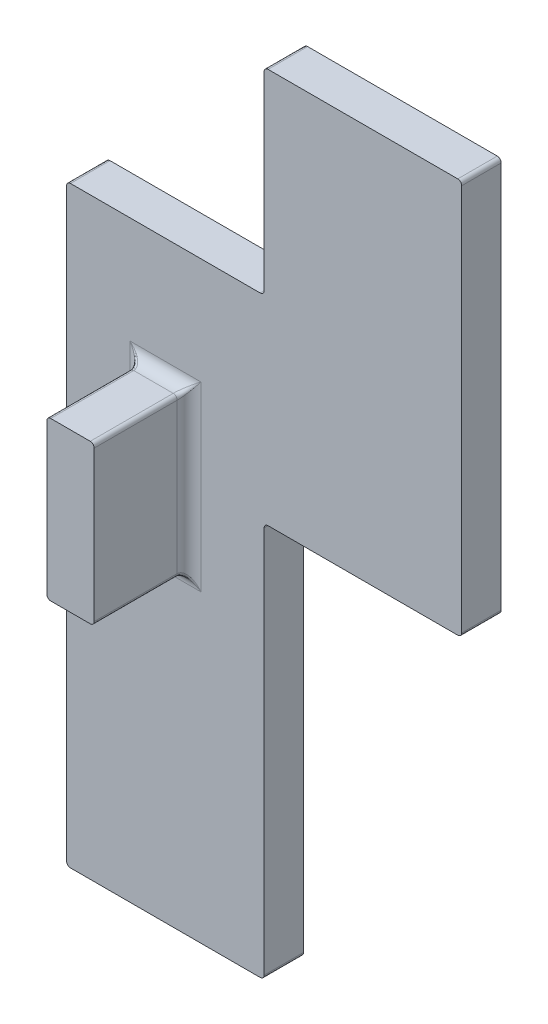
ISO-10303-21;
HEADER;
FILE_DESCRIPTION(('STEP AP214'),'2;1');
FILE_NAME('part.step','',(''),(''),'','','');
FILE_SCHEMA(('AUTOMOTIVE_DESIGN { 1 0 10303 214 1 1 1 1 }'));
ENDSEC;
DATA;
#1=APPLICATION_CONTEXT('core data for automotive mechanical design processes');
#2=APPLICATION_PROTOCOL_DEFINITION('international standard','automotive_design',2000,#1);
#3=PRODUCT_CONTEXT('',#1,'mechanical');
#4=PRODUCT('Part','Part','',(#3));
#5=PRODUCT_RELATED_PRODUCT_CATEGORY('part','',(#4));
#6=PRODUCT_DEFINITION_FORMATION('','',#4);
#7=PRODUCT_DEFINITION_CONTEXT('part definition',#1,'design');
#8=PRODUCT_DEFINITION('design','',#6,#7);
#9=PRODUCT_DEFINITION_SHAPE('','',#8);
#10=(LENGTH_UNIT() NAMED_UNIT(*) SI_UNIT(.MILLI.,.METRE.));
#11=(NAMED_UNIT(*) PLANE_ANGLE_UNIT() SI_UNIT($,.RADIAN.));
#12=(NAMED_UNIT(*) SI_UNIT($,.STERADIAN.) SOLID_ANGLE_UNIT());
#13=UNCERTAINTY_MEASURE_WITH_UNIT(LENGTH_MEASURE(1.E-05),#10,'distance_accuracy_value','');
#14=(GEOMETRIC_REPRESENTATION_CONTEXT(3) GLOBAL_UNCERTAINTY_ASSIGNED_CONTEXT((#13)) GLOBAL_UNIT_ASSIGNED_CONTEXT((#10,
#11,#12)) REPRESENTATION_CONTEXT('',''));
#15=CARTESIAN_POINT('',(0.,0.,0.));
#16=DIRECTION('',(0.,0.,1.));
#17=DIRECTION('',(1.,0.,0.));
#18=AXIS2_PLACEMENT_3D('',#15,#16,#17);
#19=CARTESIAN_POINT('',(0.,0.,5.));
#20=DIRECTION('',(0.,0.,-1.));
#21=DIRECTION('',(-1.,0.,0.));
#22=AXIS2_PLACEMENT_3D('',#19,#20,#21);
#23=PLANE('',#22);
#24=DIRECTION('',(0.,-1.,0.));
#25=VECTOR('',#24,1.);
#26=CARTESIAN_POINT('',(7.99999999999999,60.,5.));
#27=LINE('',#26,#25);
#28=CARTESIAN_POINT('',(8.,38.5,5.));
#29=VERTEX_POINT('',#28);
#30=CARTESIAN_POINT('',(7.99999999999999,61.5,5.));
#31=VERTEX_POINT('',#30);
#32=EDGE_CURVE('E377',#29,#31,#27,.F.);
#33=ORIENTED_EDGE('',*,*,#32,.T.);
#34=DIRECTION('',(-1.,0.,0.));
#35=VECTOR('',#34,1.);
#36=CARTESIAN_POINT('',(15.5,61.5,5.));
#37=LINE('',#36,#35);
#38=CARTESIAN_POINT('',(17.,61.5,5.));
#39=VERTEX_POINT('',#38);
#40=EDGE_CURVE('E381',#31,#39,#37,.F.);
#41=ORIENTED_EDGE('',*,*,#40,.T.);
#42=DIRECTION('',(0.,1.,0.));
#43=VECTOR('',#42,1.);
#44=CARTESIAN_POINT('',(17.,40.,5.));
#45=LINE('',#44,#43);
#46=CARTESIAN_POINT('',(17.,38.5,5.));
#47=VERTEX_POINT('',#46);
#48=EDGE_CURVE('E369',#39,#47,#45,.F.);
#49=ORIENTED_EDGE('',*,*,#48,.T.);
#50=DIRECTION('',(1.,0.,0.));
#51=VECTOR('',#50,1.);
#52=CARTESIAN_POINT('',(9.5,38.5,5.));
#53=LINE('',#52,#51);
#54=EDGE_CURVE('E373',#47,#29,#53,.F.);
#55=ORIENTED_EDGE('',*,*,#54,.T.);
#56=EDGE_LOOP('',(#33,#41,#49,#55));
#57=FACE_BOUND('',#56,.T.);
#58=DIRECTION('',(-1.,0.,0.));
#59=VECTOR('',#58,1.);
#60=CARTESIAN_POINT('',(25.,100.,5.));
#61=LINE('',#60,#59);
#62=CARTESIAN_POINT('',(49.5,100.,5.));
#63=VERTEX_POINT('',#62);
#64=CARTESIAN_POINT('',(25.5,100.,5.));
#65=VERTEX_POINT('',#64);
#66=EDGE_CURVE('E614',#63,#65,#61,.T.);
#67=ORIENTED_EDGE('',*,*,#66,.T.);
#68=CARTESIAN_POINT('',(25.5,99.5,5.));
#69=DIRECTION('',(0.,0.,-1.));
#70=DIRECTION('',(-1.,0.,0.));
#71=AXIS2_PLACEMENT_3D('',#68,#69,#70);
#72=CIRCLE('',#71,0.5);
#73=CARTESIAN_POINT('',(25.,99.5,5.));
#74=VERTEX_POINT('',#73);
#75=EDGE_CURVE('E309',#65,#74,#72,.F.);
#76=ORIENTED_EDGE('',*,*,#75,.T.);
#77=DIRECTION('',(0.,-1.,0.));
#78=VECTOR('',#77,1.);
#79=CARTESIAN_POINT('',(25.,75.,5.));
#80=LINE('',#79,#78);
#81=CARTESIAN_POINT('',(25.,75.5,5.));
#82=VERTEX_POINT('',#81);
#83=EDGE_CURVE('E248',#74,#82,#80,.T.);
#84=ORIENTED_EDGE('',*,*,#83,.T.);
#85=CARTESIAN_POINT('',(24.5,75.5,5.));
#86=DIRECTION('',(0.,0.,-1.));
#87=DIRECTION('',(-1.,0.,0.));
#88=AXIS2_PLACEMENT_3D('',#85,#86,#87);
#89=CIRCLE('',#88,0.5);
#90=CARTESIAN_POINT('',(24.5,75.,5.));
#91=VERTEX_POINT('',#90);
#92=EDGE_CURVE('E356',#82,#91,#89,.T.);
#93=ORIENTED_EDGE('',*,*,#92,.T.);
#94=DIRECTION('',(-1.,0.,0.));
#95=VECTOR('',#94,1.);
#96=CARTESIAN_POINT('',(0.,75.,5.));
#97=LINE('',#96,#95);
#98=CARTESIAN_POINT('',(0.5,75.,5.));
#99=VERTEX_POINT('',#98);
#100=EDGE_CURVE('E625',#91,#99,#97,.T.);
#101=ORIENTED_EDGE('',*,*,#100,.T.);
#102=CARTESIAN_POINT('',(0.5,74.5,5.));
#103=DIRECTION('',(0.,0.,-1.));
#104=DIRECTION('',(-1.,0.,0.));
#105=AXIS2_PLACEMENT_3D('',#102,#103,#104);
#106=CIRCLE('',#105,0.5);
#107=CARTESIAN_POINT('',(0.,74.5,5.));
#108=VERTEX_POINT('',#107);
#109=EDGE_CURVE('E306',#99,#108,#106,.F.);
#110=ORIENTED_EDGE('',*,*,#109,.T.);
#111=DIRECTION('',(0.,-1.,0.));
#112=VECTOR('',#111,1.);
#113=CARTESIAN_POINT('',(0.,0.,5.));
#114=LINE('',#113,#112);
#115=CARTESIAN_POINT('',(0.,0.5,5.));
#116=VERTEX_POINT('',#115);
#117=EDGE_CURVE('E274',#108,#116,#114,.T.);
#118=ORIENTED_EDGE('',*,*,#117,.T.);
#119=CARTESIAN_POINT('',(0.5,0.5,5.));
#120=DIRECTION('',(0.,0.,-1.));
#121=DIRECTION('',(-1.,0.,0.));
#122=AXIS2_PLACEMENT_3D('',#119,#120,#121);
#123=CIRCLE('',#122,0.5);
#124=CARTESIAN_POINT('',(0.500000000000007,0.,5.));
#125=VERTEX_POINT('',#124);
#126=EDGE_CURVE('E300',#116,#125,#123,.F.);
#127=ORIENTED_EDGE('',*,*,#126,.T.);
#128=DIRECTION('',(1.,0.,0.));
#129=VECTOR('',#128,1.);
#130=CARTESIAN_POINT('',(25.,0.,5.));
#131=LINE('',#130,#129);
#132=CARTESIAN_POINT('',(24.5,0.,5.));
#133=VERTEX_POINT('',#132);
#134=EDGE_CURVE('E272',#125,#133,#131,.T.);
#135=ORIENTED_EDGE('',*,*,#134,.T.);
#136=CARTESIAN_POINT('',(24.5,0.5,5.));
#137=DIRECTION('',(0.,0.,-1.));
#138=DIRECTION('',(-1.,0.,0.));
#139=AXIS2_PLACEMENT_3D('',#136,#137,#138);
#140=CIRCLE('',#139,0.5);
#141=CARTESIAN_POINT('',(25.,0.500000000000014,5.));
#142=VERTEX_POINT('',#141);
#143=EDGE_CURVE('E297',#133,#142,#140,.F.);
#144=ORIENTED_EDGE('',*,*,#143,.T.);
#145=DIRECTION('',(0.,1.,0.));
#146=VECTOR('',#145,1.);
#147=CARTESIAN_POINT('',(25.,50.,5.));
#148=LINE('',#147,#146);
#149=CARTESIAN_POINT('',(25.,49.5,5.));
#150=VERTEX_POINT('',#149);
#151=EDGE_CURVE('E619',#142,#150,#148,.T.);
#152=ORIENTED_EDGE('',*,*,#151,.T.);
#153=CARTESIAN_POINT('',(25.5,49.5,5.));
#154=DIRECTION('',(0.,0.,-1.));
#155=DIRECTION('',(-1.,0.,0.));
#156=AXIS2_PLACEMENT_3D('',#153,#154,#155);
#157=CIRCLE('',#156,0.5);
#158=CARTESIAN_POINT('',(25.5,50.,5.));
#159=VERTEX_POINT('',#158);
#160=EDGE_CURVE('E362',#150,#159,#157,.T.);
#161=ORIENTED_EDGE('',*,*,#160,.T.);
#162=DIRECTION('',(1.,0.,0.));
#163=VECTOR('',#162,1.);
#164=CARTESIAN_POINT('',(50.,50.,5.));
#165=LINE('',#164,#163);
#166=CARTESIAN_POINT('',(49.5,50.,5.));
#167=VERTEX_POINT('',#166);
#168=EDGE_CURVE('E609',#159,#167,#165,.T.);
#169=ORIENTED_EDGE('',*,*,#168,.T.);
#170=CARTESIAN_POINT('',(49.5,50.5,5.));
#171=DIRECTION('',(0.,0.,-1.));
#172=DIRECTION('',(-1.,0.,0.));
#173=AXIS2_PLACEMENT_3D('',#170,#171,#172);
#174=CIRCLE('',#173,0.5);
#175=CARTESIAN_POINT('',(50.,50.5,5.));
#176=VERTEX_POINT('',#175);
#177=EDGE_CURVE('E294',#167,#176,#174,.F.);
#178=ORIENTED_EDGE('',*,*,#177,.T.);
#179=DIRECTION('',(0.,1.,0.));
#180=VECTOR('',#179,1.);
#181=CARTESIAN_POINT('',(50.,100.,5.));
#182=LINE('',#181,#180);
#183=CARTESIAN_POINT('',(50.,99.5,5.));
#184=VERTEX_POINT('',#183);
#185=EDGE_CURVE('E606',#176,#184,#182,.T.);
#186=ORIENTED_EDGE('',*,*,#185,.T.);
#187=CARTESIAN_POINT('',(49.5,99.5,5.));
#188=DIRECTION('',(0.,0.,-1.));
#189=DIRECTION('',(-1.,0.,0.));
#190=AXIS2_PLACEMENT_3D('',#187,#188,#189);
#191=CIRCLE('',#190,0.5);
#192=EDGE_CURVE('E303',#184,#63,#191,.F.);
#193=ORIENTED_EDGE('',*,*,#192,.T.);
#194=EDGE_LOOP('',(#67,#76,#84,#93,#101,#110,#118,#127,#135,#144,#152,#161,#169,#178,#186,#193));
#195=FACE_BOUND('',#194,.T.);
#196=ADVANCED_FACE('F50',(#57,#195),#23,.F.);
#197=CARTESIAN_POINT('',(25.,0.,5.));
#198=DIRECTION('',(0.,1.,0.));
#199=DIRECTION('',(0.,0.,1.));
#200=AXIS2_PLACEMENT_3D('',#197,#198,#199);
#201=PLANE('',#200);
#202=ORIENTED_EDGE('',*,*,#134,.F.);
#203=DIRECTION('',(0.,0.,-1.));
#204=VECTOR('',#203,1.);
#205=CARTESIAN_POINT('',(0.5,0.,5.));
#206=LINE('',#205,#204);
#207=CARTESIAN_POINT('',(0.500000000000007,0.,0.));
#208=VERTEX_POINT('',#207);
#209=EDGE_CURVE('E350',#125,#208,#206,.T.);
#210=ORIENTED_EDGE('',*,*,#209,.T.);
#211=DIRECTION('',(1.,0.,0.));
#212=VECTOR('',#211,1.);
#213=CARTESIAN_POINT('',(25.,0.,0.));
#214=LINE('',#213,#212);
#215=CARTESIAN_POINT('',(24.5,0.,0.));
#216=VERTEX_POINT('',#215);
#217=EDGE_CURVE('E632',#208,#216,#214,.T.);
#218=ORIENTED_EDGE('',*,*,#217,.T.);
#219=DIRECTION('',(0.,0.,-1.));
#220=VECTOR('',#219,1.);
#221=CARTESIAN_POINT('',(24.5,0.,5.));
#222=LINE('',#221,#220);
#223=EDGE_CURVE('E347',#216,#133,#222,.F.);
#224=ORIENTED_EDGE('',*,*,#223,.T.);
#225=EDGE_LOOP('',(#202,#210,#218,#224));
#226=FACE_BOUND('',#225,.T.);
#227=ADVANCED_FACE('F523',(#226),#201,.F.);
#228=CARTESIAN_POINT('',(25.,50.,5.));
#229=DIRECTION('',(-1.,0.,0.));
#230=DIRECTION('',(0.,-1.,0.));
#231=AXIS2_PLACEMENT_3D('',#228,#229,#230);
#232=PLANE('',#231);
#233=DIRECTION('',(0.,1.,0.));
#234=VECTOR('',#233,1.);
#235=CARTESIAN_POINT('',(25.,50.,0.));
#236=LINE('',#235,#234);
#237=CARTESIAN_POINT('',(25.,0.500000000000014,0.));
#238=VERTEX_POINT('',#237);
#239=CARTESIAN_POINT('',(25.,49.5,0.));
#240=VERTEX_POINT('',#239);
#241=EDGE_CURVE('E636',#238,#240,#236,.T.);
#242=ORIENTED_EDGE('',*,*,#241,.T.);
#243=DIRECTION('',(0.,0.,-1.));
#244=VECTOR('',#243,1.);
#245=CARTESIAN_POINT('',(25.,49.5,5.));
#246=LINE('',#245,#244);
#247=EDGE_CURVE('E344',#240,#150,#246,.F.);
#248=ORIENTED_EDGE('',*,*,#247,.T.);
#249=ORIENTED_EDGE('',*,*,#151,.F.);
#250=DIRECTION('',(0.,0.,-1.));
#251=VECTOR('',#250,1.);
#252=CARTESIAN_POINT('',(25.,0.5,5.));
#253=LINE('',#252,#251);
#254=EDGE_CURVE('E340',#142,#238,#253,.T.);
#255=ORIENTED_EDGE('',*,*,#254,.T.);
#256=EDGE_LOOP('',(#242,#248,#249,#255));
#257=FACE_BOUND('',#256,.T.);
#258=ADVANCED_FACE('F531',(#257),#232,.F.);
#259=CARTESIAN_POINT('',(50.,50.,5.));
#260=DIRECTION('',(0.,1.,0.));
#261=DIRECTION('',(0.,0.,1.));
#262=AXIS2_PLACEMENT_3D('',#259,#260,#261);
#263=PLANE('',#262);
#264=ORIENTED_EDGE('',*,*,#168,.F.);
#265=DIRECTION('',(0.,0.,-1.));
#266=VECTOR('',#265,1.);
#267=CARTESIAN_POINT('',(25.5,50.,0.));
#268=LINE('',#267,#266);
#269=CARTESIAN_POINT('',(25.5,50.,0.));
#270=VERTEX_POINT('',#269);
#271=EDGE_CURVE('E336',#159,#270,#268,.T.);
#272=ORIENTED_EDGE('',*,*,#271,.T.);
#273=DIRECTION('',(1.,0.,0.));
#274=VECTOR('',#273,1.);
#275=CARTESIAN_POINT('',(50.,50.,0.));
#276=LINE('',#275,#274);
#277=CARTESIAN_POINT('',(49.5,50.,0.));
#278=VERTEX_POINT('',#277);
#279=EDGE_CURVE('E641',#270,#278,#276,.T.);
#280=ORIENTED_EDGE('',*,*,#279,.T.);
#281=DIRECTION('',(0.,0.,-1.));
#282=VECTOR('',#281,1.);
#283=CARTESIAN_POINT('',(49.5,50.,5.));
#284=LINE('',#283,#282);
#285=EDGE_CURVE('E333',#278,#167,#284,.F.);
#286=ORIENTED_EDGE('',*,*,#285,.T.);
#287=EDGE_LOOP('',(#264,#272,#280,#286));
#288=FACE_BOUND('',#287,.T.);
#289=ADVANCED_FACE('F558',(#288),#263,.F.);
#290=CARTESIAN_POINT('',(50.,100.,5.));
#291=DIRECTION('',(-1.,0.,0.));
#292=DIRECTION('',(0.,-1.,0.));
#293=AXIS2_PLACEMENT_3D('',#290,#291,#292);
#294=PLANE('',#293);
#295=DIRECTION('',(0.,1.,0.));
#296=VECTOR('',#295,1.);
#297=CARTESIAN_POINT('',(50.,100.,0.));
#298=LINE('',#297,#296);
#299=CARTESIAN_POINT('',(50.,50.5,0.));
#300=VERTEX_POINT('',#299);
#301=CARTESIAN_POINT('',(50.,99.5,0.));
#302=VERTEX_POINT('',#301);
#303=EDGE_CURVE('E265',#300,#302,#298,.T.);
#304=ORIENTED_EDGE('',*,*,#303,.T.);
#305=DIRECTION('',(0.,0.,-1.));
#306=VECTOR('',#305,1.);
#307=CARTESIAN_POINT('',(50.,99.5,5.));
#308=LINE('',#307,#306);
#309=EDGE_CURVE('E330',#302,#184,#308,.F.);
#310=ORIENTED_EDGE('',*,*,#309,.T.);
#311=ORIENTED_EDGE('',*,*,#185,.F.);
#312=DIRECTION('',(0.,0.,-1.));
#313=VECTOR('',#312,1.);
#314=CARTESIAN_POINT('',(50.,50.5,5.));
#315=LINE('',#314,#313);
#316=EDGE_CURVE('E326',#176,#300,#315,.T.);
#317=ORIENTED_EDGE('',*,*,#316,.T.);
#318=EDGE_LOOP('',(#304,#310,#311,#317));
#319=FACE_BOUND('',#318,.T.);
#320=ADVANCED_FACE('F554',(#319),#294,.F.);
#321=CARTESIAN_POINT('',(25.,100.,5.));
#322=DIRECTION('',(0.,-1.,0.));
#323=DIRECTION('',(0.,0.,-1.));
#324=AXIS2_PLACEMENT_3D('',#321,#322,#323);
#325=PLANE('',#324);
#326=DIRECTION('',(-1.,0.,0.));
#327=VECTOR('',#326,1.);
#328=CARTESIAN_POINT('',(25.,100.,0.));
#329=LINE('',#328,#327);
#330=CARTESIAN_POINT('',(49.5,100.,0.));
#331=VERTEX_POINT('',#330);
#332=CARTESIAN_POINT('',(25.5,100.,0.));
#333=VERTEX_POINT('',#332);
#334=EDGE_CURVE('E258',#331,#333,#329,.T.);
#335=ORIENTED_EDGE('',*,*,#334,.T.);
#336=DIRECTION('',(0.,0.,-1.));
#337=VECTOR('',#336,1.);
#338=CARTESIAN_POINT('',(25.5,100.,5.));
#339=LINE('',#338,#337);
#340=EDGE_CURVE('E232',#333,#65,#339,.F.);
#341=ORIENTED_EDGE('',*,*,#340,.T.);
#342=ORIENTED_EDGE('',*,*,#66,.F.);
#343=DIRECTION('',(0.,0.,-1.));
#344=VECTOR('',#343,1.);
#345=CARTESIAN_POINT('',(49.5,100.,5.));
#346=LINE('',#345,#344);
#347=EDGE_CURVE('E238',#63,#331,#346,.T.);
#348=ORIENTED_EDGE('',*,*,#347,.T.);
#349=EDGE_LOOP('',(#335,#341,#342,#348));
#350=FACE_BOUND('',#349,.T.);
#351=ADVANCED_FACE('F551',(#350),#325,.F.);
#352=CARTESIAN_POINT('',(25.,75.,5.));
#353=DIRECTION('',(1.,0.,0.));
#354=DIRECTION('',(0.,1.,0.));
#355=AXIS2_PLACEMENT_3D('',#352,#353,#354);
#356=PLANE('',#355);
#357=ORIENTED_EDGE('',*,*,#83,.F.);
#358=DIRECTION('',(0.,0.,-1.));
#359=VECTOR('',#358,1.);
#360=CARTESIAN_POINT('',(25.,99.5,5.));
#361=LINE('',#360,#359);
#362=CARTESIAN_POINT('',(25.,99.5,0.));
#363=VERTEX_POINT('',#362);
#364=EDGE_CURVE('E231',#74,#363,#361,.T.);
#365=ORIENTED_EDGE('',*,*,#364,.T.);
#366=DIRECTION('',(0.,-1.,0.));
#367=VECTOR('',#366,1.);
#368=CARTESIAN_POINT('',(25.,75.,0.));
#369=LINE('',#368,#367);
#370=CARTESIAN_POINT('',(25.,75.5,0.));
#371=VERTEX_POINT('',#370);
#372=EDGE_CURVE('E245',#363,#371,#369,.T.);
#373=ORIENTED_EDGE('',*,*,#372,.T.);
#374=DIRECTION('',(0.,0.,-1.));
#375=VECTOR('',#374,1.);
#376=CARTESIAN_POINT('',(25.,75.5,5.));
#377=LINE('',#376,#375);
#378=EDGE_CURVE('E251',#371,#82,#377,.F.);
#379=ORIENTED_EDGE('',*,*,#378,.T.);
#380=EDGE_LOOP('',(#357,#365,#373,#379));
#381=FACE_BOUND('',#380,.T.);
#382=ADVANCED_FACE('F244',(#381),#356,.F.);
#383=CARTESIAN_POINT('',(0.,75.,5.));
#384=DIRECTION('',(0.,-1.,0.));
#385=DIRECTION('',(0.,0.,-1.));
#386=AXIS2_PLACEMENT_3D('',#383,#384,#385);
#387=PLANE('',#386);
#388=ORIENTED_EDGE('',*,*,#100,.F.);
#389=DIRECTION('',(0.,0.,-1.));
#390=VECTOR('',#389,1.);
#391=CARTESIAN_POINT('',(24.5,75.,0.));
#392=LINE('',#391,#390);
#393=CARTESIAN_POINT('',(24.5,75.,0.));
#394=VERTEX_POINT('',#393);
#395=EDGE_CURVE('E315',#91,#394,#392,.T.);
#396=ORIENTED_EDGE('',*,*,#395,.T.);
#397=DIRECTION('',(-1.,0.,0.));
#398=VECTOR('',#397,1.);
#399=CARTESIAN_POINT('',(0.,75.,0.));
#400=LINE('',#399,#398);
#401=CARTESIAN_POINT('',(0.5,75.,0.));
#402=VERTEX_POINT('',#401);
#403=EDGE_CURVE('E257',#394,#402,#400,.T.);
#404=ORIENTED_EDGE('',*,*,#403,.T.);
#405=DIRECTION('',(0.,0.,-1.));
#406=VECTOR('',#405,1.);
#407=CARTESIAN_POINT('',(0.5,75.,5.));
#408=LINE('',#407,#406);
#409=EDGE_CURVE('E312',#402,#99,#408,.F.);
#410=ORIENTED_EDGE('',*,*,#409,.T.);
#411=EDGE_LOOP('',(#388,#396,#404,#410));
#412=FACE_BOUND('',#411,.T.);
#413=ADVANCED_FACE('F544',(#412),#387,.F.);
#414=CARTESIAN_POINT('',(0.,0.,5.));
#415=DIRECTION('',(1.,0.,0.));
#416=DIRECTION('',(0.,0.,-1.));
#417=AXIS2_PLACEMENT_3D('',#414,#415,#416);
#418=PLANE('',#417);
#419=ORIENTED_EDGE('',*,*,#117,.F.);
#420=DIRECTION('',(0.,0.,-1.));
#421=VECTOR('',#420,1.);
#422=CARTESIAN_POINT('',(0.,74.5,5.));
#423=LINE('',#422,#421);
#424=CARTESIAN_POINT('',(0.,74.5,0.));
#425=VERTEX_POINT('',#424);
#426=EDGE_CURVE('E322',#108,#425,#423,.T.);
#427=ORIENTED_EDGE('',*,*,#426,.T.);
#428=DIRECTION('',(0.,-1.,0.));
#429=VECTOR('',#428,1.);
#430=CARTESIAN_POINT('',(0.,0.,0.));
#431=LINE('',#430,#429);
#432=CARTESIAN_POINT('',(0.,0.5,0.));
#433=VERTEX_POINT('',#432);
#434=EDGE_CURVE('E263',#425,#433,#431,.T.);
#435=ORIENTED_EDGE('',*,*,#434,.T.);
#436=DIRECTION('',(0.,0.,-1.));
#437=VECTOR('',#436,1.);
#438=CARTESIAN_POINT('',(0.,0.5,5.));
#439=LINE('',#438,#437);
#440=EDGE_CURVE('E319',#433,#116,#439,.F.);
#441=ORIENTED_EDGE('',*,*,#440,.T.);
#442=EDGE_LOOP('',(#419,#427,#435,#441));
#443=FACE_BOUND('',#442,.T.);
#444=ADVANCED_FACE('F541',(#443),#418,.F.);
#445=CARTESIAN_POINT('',(0.,0.,0.));
#446=DIRECTION('',(0.,0.,-1.));
#447=DIRECTION('',(-1.,0.,0.));
#448=AXIS2_PLACEMENT_3D('',#445,#446,#447);
#449=PLANE('',#448);
#450=ORIENTED_EDGE('',*,*,#372,.F.);
#451=CARTESIAN_POINT('',(25.5,99.5,0.));
#452=DIRECTION('',(0.,0.,-1.));
#453=DIRECTION('',(-1.,0.,0.));
#454=AXIS2_PLACEMENT_3D('',#451,#452,#453);
#455=CIRCLE('',#454,0.5);
#456=EDGE_CURVE('E227',#363,#333,#455,.T.);
#457=ORIENTED_EDGE('',*,*,#456,.T.);
#458=ORIENTED_EDGE('',*,*,#334,.F.);
#459=CARTESIAN_POINT('',(49.5,99.5,0.));
#460=DIRECTION('',(0.,0.,-1.));
#461=DIRECTION('',(-1.,0.,0.));
#462=AXIS2_PLACEMENT_3D('',#459,#460,#461);
#463=CIRCLE('',#462,0.5);
#464=EDGE_CURVE('E284',#331,#302,#463,.T.);
#465=ORIENTED_EDGE('',*,*,#464,.T.);
#466=ORIENTED_EDGE('',*,*,#303,.F.);
#467=CARTESIAN_POINT('',(49.5,50.5,0.));
#468=DIRECTION('',(0.,0.,-1.));
#469=DIRECTION('',(-1.,0.,0.));
#470=AXIS2_PLACEMENT_3D('',#467,#468,#469);
#471=CIRCLE('',#470,0.5);
#472=EDGE_CURVE('E250',#300,#278,#471,.T.);
#473=ORIENTED_EDGE('',*,*,#472,.T.);
#474=ORIENTED_EDGE('',*,*,#279,.F.);
#475=CARTESIAN_POINT('',(25.5,49.5,0.));
#476=DIRECTION('',(0.,0.,-1.));
#477=DIRECTION('',(-1.,0.,0.));
#478=AXIS2_PLACEMENT_3D('',#475,#476,#477);
#479=CIRCLE('',#478,0.5);
#480=EDGE_CURVE('E359',#270,#240,#479,.F.);
#481=ORIENTED_EDGE('',*,*,#480,.T.);
#482=ORIENTED_EDGE('',*,*,#241,.F.);
#483=CARTESIAN_POINT('',(24.5,0.5,0.));
#484=DIRECTION('',(0.,0.,-1.));
#485=DIRECTION('',(-1.,0.,0.));
#486=AXIS2_PLACEMENT_3D('',#483,#484,#485);
#487=CIRCLE('',#486,0.5);
#488=EDGE_CURVE('E278',#238,#216,#487,.T.);
#489=ORIENTED_EDGE('',*,*,#488,.T.);
#490=ORIENTED_EDGE('',*,*,#217,.F.);
#491=CARTESIAN_POINT('',(0.5,0.5,0.));
#492=DIRECTION('',(0.,0.,-1.));
#493=DIRECTION('',(-1.,0.,0.));
#494=AXIS2_PLACEMENT_3D('',#491,#492,#493);
#495=CIRCLE('',#494,0.5);
#496=EDGE_CURVE('E281',#208,#433,#495,.T.);
#497=ORIENTED_EDGE('',*,*,#496,.T.);
#498=ORIENTED_EDGE('',*,*,#434,.F.);
#499=CARTESIAN_POINT('',(0.5,74.5,0.));
#500=DIRECTION('',(0.,0.,-1.));
#501=DIRECTION('',(-1.,0.,0.));
#502=AXIS2_PLACEMENT_3D('',#499,#500,#501);
#503=CIRCLE('',#502,0.5);
#504=EDGE_CURVE('E239',#425,#402,#503,.T.);
#505=ORIENTED_EDGE('',*,*,#504,.T.);
#506=ORIENTED_EDGE('',*,*,#403,.F.);
#507=CARTESIAN_POINT('',(24.5,75.5,0.));
#508=DIRECTION('',(0.,0.,-1.));
#509=DIRECTION('',(-1.,0.,0.));
#510=AXIS2_PLACEMENT_3D('',#507,#508,#509);
#511=CIRCLE('',#510,0.5);
#512=EDGE_CURVE('E255',#394,#371,#511,.F.);
#513=ORIENTED_EDGE('',*,*,#512,.T.);
#514=EDGE_LOOP('',(#450,#457,#458,#465,#466,#473,#474,#481,#482,#489,#490,#497,#498,#505,#506,#513));
#515=FACE_BOUND('',#514,.T.);
#516=ADVANCED_FACE('F253',(#515),#449,.T.);
#517=CARTESIAN_POINT('',(25.5,99.5,5.));
#518=DIRECTION('',(0.,0.,-1.));
#519=DIRECTION('',(-1.,0.,0.));
#520=AXIS2_PLACEMENT_3D('',#517,#518,#519);
#521=CYLINDRICAL_SURFACE('',#520,0.5);
#522=ORIENTED_EDGE('',*,*,#75,.F.);
#523=ORIENTED_EDGE('',*,*,#340,.F.);
#524=ORIENTED_EDGE('',*,*,#456,.F.);
#525=ORIENTED_EDGE('',*,*,#364,.F.);
#526=EDGE_LOOP('',(#522,#523,#524,#525));
#527=FACE_BOUND('',#526,.T.);
#528=ADVANCED_FACE('F230',(#527),#521,.T.);
#529=CARTESIAN_POINT('',(24.5,75.5,5.));
#530=DIRECTION('',(0.,0.,1.));
#531=DIRECTION('',(1.,0.,0.));
#532=AXIS2_PLACEMENT_3D('',#529,#530,#531);
#533=CYLINDRICAL_SURFACE('',#532,0.5);
#534=ORIENTED_EDGE('',*,*,#92,.F.);
#535=ORIENTED_EDGE('',*,*,#378,.F.);
#536=ORIENTED_EDGE('',*,*,#512,.F.);
#537=ORIENTED_EDGE('',*,*,#395,.F.);
#538=EDGE_LOOP('',(#534,#535,#536,#537));
#539=FACE_BOUND('',#538,.T.);
#540=ADVANCED_FACE('F568',(#539),#533,.F.);
#541=CARTESIAN_POINT('',(0.5,74.5,5.));
#542=DIRECTION('',(0.,0.,-1.));
#543=DIRECTION('',(-1.,0.,0.));
#544=AXIS2_PLACEMENT_3D('',#541,#542,#543);
#545=CYLINDRICAL_SURFACE('',#544,0.5);
#546=ORIENTED_EDGE('',*,*,#109,.F.);
#547=ORIENTED_EDGE('',*,*,#409,.F.);
#548=ORIENTED_EDGE('',*,*,#504,.F.);
#549=ORIENTED_EDGE('',*,*,#426,.F.);
#550=EDGE_LOOP('',(#546,#547,#548,#549));
#551=FACE_BOUND('',#550,.T.);
#552=ADVANCED_FACE('F571',(#551),#545,.T.);
#553=CARTESIAN_POINT('',(49.5,99.5,5.));
#554=DIRECTION('',(0.,0.,-1.));
#555=DIRECTION('',(-1.,0.,0.));
#556=AXIS2_PLACEMENT_3D('',#553,#554,#555);
#557=CYLINDRICAL_SURFACE('',#556,0.5);
#558=ORIENTED_EDGE('',*,*,#192,.F.);
#559=ORIENTED_EDGE('',*,*,#309,.F.);
#560=ORIENTED_EDGE('',*,*,#464,.F.);
#561=ORIENTED_EDGE('',*,*,#347,.F.);
#562=EDGE_LOOP('',(#558,#559,#560,#561));
#563=FACE_BOUND('',#562,.T.);
#564=ADVANCED_FACE('F575',(#563),#557,.T.);
#565=CARTESIAN_POINT('',(25.5,49.5,5.));
#566=DIRECTION('',(0.,0.,1.));
#567=DIRECTION('',(1.,0.,0.));
#568=AXIS2_PLACEMENT_3D('',#565,#566,#567);
#569=CYLINDRICAL_SURFACE('',#568,0.5);
#570=ORIENTED_EDGE('',*,*,#160,.F.);
#571=ORIENTED_EDGE('',*,*,#247,.F.);
#572=ORIENTED_EDGE('',*,*,#480,.F.);
#573=ORIENTED_EDGE('',*,*,#271,.F.);
#574=EDGE_LOOP('',(#570,#571,#572,#573));
#575=FACE_BOUND('',#574,.T.);
#576=ADVANCED_FACE('F579',(#575),#569,.F.);
#577=CARTESIAN_POINT('',(0.5,0.5,5.));
#578=DIRECTION('',(0.,0.,-1.));
#579=DIRECTION('',(-1.,0.,0.));
#580=AXIS2_PLACEMENT_3D('',#577,#578,#579);
#581=CYLINDRICAL_SURFACE('',#580,0.5);
#582=ORIENTED_EDGE('',*,*,#126,.F.);
#583=ORIENTED_EDGE('',*,*,#440,.F.);
#584=ORIENTED_EDGE('',*,*,#496,.F.);
#585=ORIENTED_EDGE('',*,*,#209,.F.);
#586=EDGE_LOOP('',(#582,#583,#584,#585));
#587=FACE_BOUND('',#586,.T.);
#588=ADVANCED_FACE('F583',(#587),#581,.T.);
#589=CARTESIAN_POINT('',(24.5,0.5,5.));
#590=DIRECTION('',(0.,0.,-1.));
#591=DIRECTION('',(-1.,0.,0.));
#592=AXIS2_PLACEMENT_3D('',#589,#590,#591);
#593=CYLINDRICAL_SURFACE('',#592,0.5);
#594=ORIENTED_EDGE('',*,*,#143,.F.);
#595=ORIENTED_EDGE('',*,*,#223,.F.);
#596=ORIENTED_EDGE('',*,*,#488,.F.);
#597=ORIENTED_EDGE('',*,*,#254,.F.);
#598=EDGE_LOOP('',(#594,#595,#596,#597));
#599=FACE_BOUND('',#598,.T.);
#600=ADVANCED_FACE('F587',(#599),#593,.T.);
#601=CARTESIAN_POINT('',(49.5,50.5,5.));
#602=DIRECTION('',(0.,0.,-1.));
#603=DIRECTION('',(-1.,0.,0.));
#604=AXIS2_PLACEMENT_3D('',#601,#602,#603);
#605=CYLINDRICAL_SURFACE('',#604,0.5);
#606=ORIENTED_EDGE('',*,*,#177,.F.);
#607=ORIENTED_EDGE('',*,*,#285,.F.);
#608=ORIENTED_EDGE('',*,*,#472,.F.);
#609=ORIENTED_EDGE('',*,*,#316,.F.);
#610=EDGE_LOOP('',(#606,#607,#608,#609));
#611=FACE_BOUND('',#610,.T.);
#612=ADVANCED_FACE('F590',(#611),#605,.T.);
#613=CARTESIAN_POINT('',(9.49999999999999,60.,17.));
#614=DIRECTION('',(1.,0.,0.));
#615=DIRECTION('',(0.,1.,0.));
#616=AXIS2_PLACEMENT_3D('',#613,#614,#615);
#617=PLANE('',#616);
#618=DIRECTION('',(0.,-1.,0.));
#619=VECTOR('',#618,1.);
#620=CARTESIAN_POINT('',(9.5,40.,6.5));
#621=LINE('',#620,#619);
#622=CARTESIAN_POINT('',(9.49999999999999,59.5,6.5));
#623=VERTEX_POINT('',#622);
#624=CARTESIAN_POINT('',(9.5,40.5,6.5));
#625=VERTEX_POINT('',#624);
#626=EDGE_CURVE('E385',#623,#625,#621,.T.);
#627=ORIENTED_EDGE('',*,*,#626,.T.);
#628=DIRECTION('',(0.,0.,-1.));
#629=VECTOR('',#628,1.);
#630=CARTESIAN_POINT('',(9.5,40.5,17.));
#631=LINE('',#630,#629);
#632=CARTESIAN_POINT('',(9.5,40.5,17.));
#633=VERTEX_POINT('',#632);
#634=EDGE_CURVE('E11',#625,#633,#631,.F.);
#635=ORIENTED_EDGE('',*,*,#634,.T.);
#636=DIRECTION('',(0.,-1.,0.));
#637=VECTOR('',#636,1.);
#638=CARTESIAN_POINT('',(9.49999999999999,60.,17.));
#639=LINE('',#638,#637);
#640=CARTESIAN_POINT('',(9.49999999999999,59.5,17.));
#641=VERTEX_POINT('',#640);
#642=EDGE_CURVE('E458',#641,#633,#639,.T.);
#643=ORIENTED_EDGE('',*,*,#642,.F.);
#644=DIRECTION('',(0.,0.,-1.));
#645=VECTOR('',#644,1.);
#646=CARTESIAN_POINT('',(9.49999999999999,59.5,17.));
#647=LINE('',#646,#645);
#648=EDGE_CURVE('E60',#641,#623,#647,.T.);
#649=ORIENTED_EDGE('',*,*,#648,.T.);
#650=EDGE_LOOP('',(#627,#635,#643,#649));
#651=FACE_BOUND('',#650,.T.);
#652=ADVANCED_FACE('F592',(#651),#617,.F.);
#653=CARTESIAN_POINT('',(9.5,40.,17.));
#654=DIRECTION('',(0.,1.,0.));
#655=DIRECTION('',(-1.,0.,0.));
#656=AXIS2_PLACEMENT_3D('',#653,#654,#655);
#657=PLANE('',#656);
#658=DIRECTION('',(1.,0.,0.));
#659=VECTOR('',#658,1.);
#660=CARTESIAN_POINT('',(15.5,40.,6.5));
#661=LINE('',#660,#659);
#662=CARTESIAN_POINT('',(10.,40.,6.5));
#663=VERTEX_POINT('',#662);
#664=CARTESIAN_POINT('',(15.,40.,6.5));
#665=VERTEX_POINT('',#664);
#666=EDGE_CURVE('E389',#663,#665,#661,.T.);
#667=ORIENTED_EDGE('',*,*,#666,.T.);
#668=DIRECTION('',(0.,0.,-1.));
#669=VECTOR('',#668,1.);
#670=CARTESIAN_POINT('',(15.,40.,17.));
#671=LINE('',#670,#669);
#672=CARTESIAN_POINT('',(15.,40.,17.));
#673=VERTEX_POINT('',#672);
#674=EDGE_CURVE('E68',#665,#673,#671,.F.);
#675=ORIENTED_EDGE('',*,*,#674,.T.);
#676=DIRECTION('',(1.,0.,0.));
#677=VECTOR('',#676,1.);
#678=CARTESIAN_POINT('',(9.5,40.,17.));
#679=LINE('',#678,#677);
#680=CARTESIAN_POINT('',(10.,40.,17.));
#681=VERTEX_POINT('',#680);
#682=EDGE_CURVE('E688',#681,#673,#679,.T.);
#683=ORIENTED_EDGE('',*,*,#682,.F.);
#684=DIRECTION('',(0.,0.,-1.));
#685=VECTOR('',#684,1.);
#686=CARTESIAN_POINT('',(10.,40.,17.));
#687=LINE('',#686,#685);
#688=EDGE_CURVE('E447',#681,#663,#687,.T.);
#689=ORIENTED_EDGE('',*,*,#688,.T.);
#690=EDGE_LOOP('',(#667,#675,#683,#689));
#691=FACE_BOUND('',#690,.T.);
#692=ADVANCED_FACE('F596',(#691),#657,.F.);
#693=CARTESIAN_POINT('',(15.5,60.,17.));
#694=DIRECTION('',(-1.,0.,0.));
#695=DIRECTION('',(0.,-1.,0.));
#696=AXIS2_PLACEMENT_3D('',#693,#694,#695);
#697=PLANE('',#696);
#698=DIRECTION('',(0.,1.,0.));
#699=VECTOR('',#698,1.);
#700=CARTESIAN_POINT('',(15.5,60.,6.5));
#701=LINE('',#700,#699);
#702=CARTESIAN_POINT('',(15.5,40.5,6.5));
#703=VERTEX_POINT('',#702);
#704=CARTESIAN_POINT('',(15.5,59.5,6.5));
#705=VERTEX_POINT('',#704);
#706=EDGE_CURVE('E392',#703,#705,#701,.T.);
#707=ORIENTED_EDGE('',*,*,#706,.T.);
#708=DIRECTION('',(0.,0.,-1.));
#709=VECTOR('',#708,1.);
#710=CARTESIAN_POINT('',(15.5,59.5,17.));
#711=LINE('',#710,#709);
#712=CARTESIAN_POINT('',(15.5,59.5,17.));
#713=VERTEX_POINT('',#712);
#714=EDGE_CURVE('E433',#705,#713,#711,.F.);
#715=ORIENTED_EDGE('',*,*,#714,.T.);
#716=DIRECTION('',(0.,1.,0.));
#717=VECTOR('',#716,1.);
#718=CARTESIAN_POINT('',(15.5,60.,17.));
#719=LINE('',#718,#717);
#720=CARTESIAN_POINT('',(15.5,40.5,17.));
#721=VERTEX_POINT('',#720);
#722=EDGE_CURVE('E684',#721,#713,#719,.T.);
#723=ORIENTED_EDGE('',*,*,#722,.F.);
#724=DIRECTION('',(0.,0.,-1.));
#725=VECTOR('',#724,1.);
#726=CARTESIAN_POINT('',(15.5,40.5,17.));
#727=LINE('',#726,#725);
#728=EDGE_CURVE('E430',#721,#703,#727,.T.);
#729=ORIENTED_EDGE('',*,*,#728,.T.);
#730=EDGE_LOOP('',(#707,#715,#723,#729));
#731=FACE_BOUND('',#730,.T.);
#732=ADVANCED_FACE('F721',(#731),#697,.F.);
#733=CARTESIAN_POINT('',(9.49999999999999,60.,17.));
#734=DIRECTION('',(0.,-1.,0.));
#735=DIRECTION('',(0.,0.,-1.));
#736=AXIS2_PLACEMENT_3D('',#733,#734,#735);
#737=PLANE('',#736);
#738=DIRECTION('',(-1.,0.,0.));
#739=VECTOR('',#738,1.);
#740=CARTESIAN_POINT('',(9.49999999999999,60.,17.));
#741=LINE('',#740,#739);
#742=CARTESIAN_POINT('',(15.,60.,17.));
#743=VERTEX_POINT('',#742);
#744=CARTESIAN_POINT('',(9.99999999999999,60.,17.));
#745=VERTEX_POINT('',#744);
#746=EDGE_CURVE('E677',#743,#745,#741,.T.);
#747=ORIENTED_EDGE('',*,*,#746,.F.);
#748=DIRECTION('',(0.,0.,-1.));
#749=VECTOR('',#748,1.);
#750=CARTESIAN_POINT('',(15.,60.,17.));
#751=LINE('',#750,#749);
#752=CARTESIAN_POINT('',(15.,60.,6.5));
#753=VERTEX_POINT('',#752);
#754=EDGE_CURVE('E427',#743,#753,#751,.T.);
#755=ORIENTED_EDGE('',*,*,#754,.T.);
#756=DIRECTION('',(-1.,0.,0.));
#757=VECTOR('',#756,1.);
#758=CARTESIAN_POINT('',(9.49999999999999,60.,6.5));
#759=LINE('',#758,#757);
#760=CARTESIAN_POINT('',(9.99999999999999,60.,6.5));
#761=VERTEX_POINT('',#760);
#762=EDGE_CURVE('E365',#753,#761,#759,.T.);
#763=ORIENTED_EDGE('',*,*,#762,.T.);
#764=DIRECTION('',(0.,0.,-1.));
#765=VECTOR('',#764,1.);
#766=CARTESIAN_POINT('',(9.99999999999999,60.,17.));
#767=LINE('',#766,#765);
#768=EDGE_CURVE('E424',#761,#745,#767,.F.);
#769=ORIENTED_EDGE('',*,*,#768,.T.);
#770=EDGE_LOOP('',(#747,#755,#763,#769));
#771=FACE_BOUND('',#770,.T.);
#772=ADVANCED_FACE('F734',(#771),#737,.F.);
#773=CARTESIAN_POINT('',(0.,0.,17.));
#774=DIRECTION('',(0.,0.,1.));
#775=DIRECTION('',(1.,0.,0.));
#776=AXIS2_PLACEMENT_3D('',#773,#774,#775);
#777=PLANE('',#776);
#778=ORIENTED_EDGE('',*,*,#722,.T.);
#779=CARTESIAN_POINT('',(15.,59.5,17.));
#780=DIRECTION('',(0.,0.,1.));
#781=DIRECTION('',(1.,0.,0.));
#782=AXIS2_PLACEMENT_3D('',#779,#780,#781);
#783=CIRCLE('',#782,0.5);
#784=EDGE_CURVE('E444',#713,#743,#783,.T.);
#785=ORIENTED_EDGE('',*,*,#784,.T.);
#786=ORIENTED_EDGE('',*,*,#746,.T.);
#787=CARTESIAN_POINT('',(9.99999999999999,59.5,17.));
#788=DIRECTION('',(0.,0.,1.));
#789=DIRECTION('',(1.,0.,0.));
#790=AXIS2_PLACEMENT_3D('',#787,#788,#789);
#791=CIRCLE('',#790,0.5);
#792=EDGE_CURVE('E436',#745,#641,#791,.T.);
#793=ORIENTED_EDGE('',*,*,#792,.T.);
#794=ORIENTED_EDGE('',*,*,#642,.T.);
#795=CARTESIAN_POINT('',(10.,40.5,17.));
#796=DIRECTION('',(0.,0.,1.));
#797=DIRECTION('',(1.,0.,0.));
#798=AXIS2_PLACEMENT_3D('',#795,#796,#797);
#799=CIRCLE('',#798,0.5);
#800=EDGE_CURVE('E75',#633,#681,#799,.T.);
#801=ORIENTED_EDGE('',*,*,#800,.T.);
#802=ORIENTED_EDGE('',*,*,#682,.T.);
#803=CARTESIAN_POINT('',(15.,40.5,17.));
#804=DIRECTION('',(0.,0.,1.));
#805=DIRECTION('',(1.,0.,0.));
#806=AXIS2_PLACEMENT_3D('',#803,#804,#805);
#807=CIRCLE('',#806,0.5);
#808=EDGE_CURVE('E441',#673,#721,#807,.T.);
#809=ORIENTED_EDGE('',*,*,#808,.T.);
#810=EDGE_LOOP('',(#778,#785,#786,#793,#794,#801,#802,#809));
#811=FACE_BOUND('',#810,.T.);
#812=ADVANCED_FACE('F693',(#811),#777,.T.);
#813=CARTESIAN_POINT('',(9.5,38.5,6.5));
#814=DIRECTION('',(-1.,0.,0.));
#815=DIRECTION('',(0.,-1.,0.));
#816=AXIS2_PLACEMENT_3D('',#813,#814,#815);
#817=CYLINDRICAL_SURFACE('',#816,1.5);
#818=ORIENTED_EDGE('',*,*,#54,.F.);
#819=CARTESIAN_POINT('',(17.,38.5,6.5));
#820=DIRECTION('',(0.599999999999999,0.800000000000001,0.));
#821=DIRECTION('',(0.800000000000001,-0.599999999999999,0.));
#822=AXIS2_PLACEMENT_3D('',#819,#820,#821);
#823=ELLIPSE('',#822,2.5,1.5);
#824=EDGE_CURVE('E414',#47,#665,#823,.T.);
#825=ORIENTED_EDGE('',*,*,#824,.T.);
#826=ORIENTED_EDGE('',*,*,#666,.F.);
#827=CARTESIAN_POINT('',(8.,38.5,6.5));
#828=DIRECTION('',(0.600000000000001,-0.799999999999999,0.));
#829=DIRECTION('',(0.799999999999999,0.600000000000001,0.));
#830=AXIS2_PLACEMENT_3D('',#827,#828,#829);
#831=ELLIPSE('',#830,2.5,1.5);
#832=EDGE_CURVE('E411',#663,#29,#831,.F.);
#833=ORIENTED_EDGE('',*,*,#832,.T.);
#834=EDGE_LOOP('',(#818,#825,#826,#833));
#835=FACE_BOUND('',#834,.T.);
#836=ADVANCED_FACE('F475',(#835),#817,.F.);
#837=CARTESIAN_POINT('',(17.,60.,6.5));
#838=DIRECTION('',(0.,-1.,0.));
#839=DIRECTION('',(1.,0.,0.));
#840=AXIS2_PLACEMENT_3D('',#837,#838,#839);
#841=CYLINDRICAL_SURFACE('',#840,1.5);
#842=ORIENTED_EDGE('',*,*,#48,.F.);
#843=CARTESIAN_POINT('',(17.,61.5,6.5));
#844=DIRECTION('',(-0.8,0.6,0.));
#845=DIRECTION('',(0.600000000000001,0.8,0.));
#846=AXIS2_PLACEMENT_3D('',#843,#844,#845);
#847=ELLIPSE('',#846,2.5,1.5);
#848=EDGE_CURVE('E408',#39,#705,#847,.T.);
#849=ORIENTED_EDGE('',*,*,#848,.T.);
#850=ORIENTED_EDGE('',*,*,#706,.F.);
#851=CARTESIAN_POINT('',(17.,38.5,6.5));
#852=DIRECTION('',(0.799999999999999,0.600000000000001,0.));
#853=DIRECTION('',(0.600000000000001,-0.799999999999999,0.));
#854=AXIS2_PLACEMENT_3D('',#851,#852,#853);
#855=ELLIPSE('',#854,2.5,1.5);
#856=EDGE_CURVE('E404',#703,#47,#855,.F.);
#857=ORIENTED_EDGE('',*,*,#856,.T.);
#858=EDGE_LOOP('',(#842,#849,#850,#857));
#859=FACE_BOUND('',#858,.T.);
#860=ADVANCED_FACE('F482',(#859),#841,.F.);
#861=CARTESIAN_POINT('',(7.99999999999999,60.,6.5));
#862=DIRECTION('',(0.,1.,0.));
#863=DIRECTION('',(-1.,0.,0.));
#864=AXIS2_PLACEMENT_3D('',#861,#862,#863);
#865=CYLINDRICAL_SURFACE('',#864,1.5);
#866=ORIENTED_EDGE('',*,*,#32,.F.);
#867=CARTESIAN_POINT('',(8.,38.5,6.5));
#868=DIRECTION('',(0.8,-0.599999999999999,0.));
#869=DIRECTION('',(0.599999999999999,0.8,0.));
#870=AXIS2_PLACEMENT_3D('',#867,#868,#869);
#871=ELLIPSE('',#870,2.5,1.5);
#872=EDGE_CURVE('E420',#29,#625,#871,.T.);
#873=ORIENTED_EDGE('',*,*,#872,.T.);
#874=ORIENTED_EDGE('',*,*,#626,.F.);
#875=CARTESIAN_POINT('',(7.99999999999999,61.5,6.5));
#876=DIRECTION('',(-0.8,-0.6,0.));
#877=DIRECTION('',(0.600000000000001,-0.8,0.));
#878=AXIS2_PLACEMENT_3D('',#875,#876,#877);
#879=ELLIPSE('',#878,2.5,1.5);
#880=EDGE_CURVE('E417',#623,#31,#879,.F.);
#881=ORIENTED_EDGE('',*,*,#880,.T.);
#882=EDGE_LOOP('',(#866,#873,#874,#881));
#883=FACE_BOUND('',#882,.T.);
#884=ADVANCED_FACE('F485',(#883),#865,.F.);
#885=CARTESIAN_POINT('',(9.49999999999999,61.5,6.5));
#886=DIRECTION('',(1.,0.,0.));
#887=DIRECTION('',(0.,0.,-1.));
#888=AXIS2_PLACEMENT_3D('',#885,#886,#887);
#889=CYLINDRICAL_SURFACE('',#888,1.5);
#890=ORIENTED_EDGE('',*,*,#762,.F.);
#891=CARTESIAN_POINT('',(17.,61.5,6.5));
#892=DIRECTION('',(-0.6,0.8,0.));
#893=DIRECTION('',(0.8,0.6,0.));
#894=AXIS2_PLACEMENT_3D('',#891,#892,#893);
#895=ELLIPSE('',#894,2.5,1.5);
#896=EDGE_CURVE('E400',#753,#39,#895,.F.);
#897=ORIENTED_EDGE('',*,*,#896,.T.);
#898=ORIENTED_EDGE('',*,*,#40,.F.);
#899=CARTESIAN_POINT('',(7.99999999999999,61.5,6.5));
#900=DIRECTION('',(-0.599999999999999,-0.8,0.));
#901=DIRECTION('',(0.8,-0.599999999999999,0.));
#902=AXIS2_PLACEMENT_3D('',#899,#900,#901);
#903=ELLIPSE('',#902,2.5,1.5);
#904=EDGE_CURVE('E396',#31,#761,#903,.T.);
#905=ORIENTED_EDGE('',*,*,#904,.T.);
#906=EDGE_LOOP('',(#890,#897,#898,#905));
#907=FACE_BOUND('',#906,.T.);
#908=ADVANCED_FACE('F478',(#907),#889,.F.);
#909=CARTESIAN_POINT('',(15.,59.5,17.));
#910=DIRECTION('',(0.,0.,-1.));
#911=DIRECTION('',(-1.,0.,0.));
#912=AXIS2_PLACEMENT_3D('',#909,#910,#911);
#913=CYLINDRICAL_SURFACE('',#912,0.5);
#914=ORIENTED_EDGE('',*,*,#784,.F.);
#915=ORIENTED_EDGE('',*,*,#714,.F.);
#916=CARTESIAN_POINT('',(15.,59.5,6.5));
#917=DIRECTION('',(0.,0.,-1.));
#918=DIRECTION('',(-1.,0.,0.));
#919=AXIS2_PLACEMENT_3D('',#916,#917,#918);
#920=CIRCLE('',#919,0.5);
#921=EDGE_CURVE('E454',#753,#705,#920,.T.);
#922=ORIENTED_EDGE('',*,*,#921,.F.);
#923=ORIENTED_EDGE('',*,*,#754,.F.);
#924=EDGE_LOOP('',(#914,#915,#922,#923));
#925=FACE_BOUND('',#924,.T.);
#926=ADVANCED_FACE('F473',(#925),#913,.T.);
#927=CARTESIAN_POINT('',(17.,61.5,8.));
#928=CARTESIAN_POINT('',(17.,61.5,8.));
#929=CARTESIAN_POINT('',(17.,61.5,8.));
#930=CARTESIAN_POINT('',(16.9346528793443,61.4128705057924,7.99997370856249));
#931=CARTESIAN_POINT('',(16.9237465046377,61.4237465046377,8.00009886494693));
#932=CARTESIAN_POINT('',(16.9128705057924,61.4346528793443,7.99997370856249));
#933=CARTESIAN_POINT('',(16.8692890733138,61.3257187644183,7.99572763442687));
#934=CARTESIAN_POINT('',(16.8472831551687,61.3472831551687,7.99430068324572));
#935=CARTESIAN_POINT('',(16.8257187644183,61.3692890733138,7.99572763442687));
#936=CARTESIAN_POINT('',(16.7396855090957,61.1529140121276,7.97867971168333));
#937=CARTESIAN_POINT('',(16.6966502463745,61.1966502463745,7.97154804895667));
#938=CARTESIAN_POINT('',(16.6529140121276,61.2396855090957,7.97867971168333));
#939=CARTESIAN_POINT('',(16.6754409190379,61.0672545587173,7.96595089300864));
#940=CARTESIAN_POINT('',(16.6220481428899,61.12204814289,7.95456095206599));
#941=CARTESIAN_POINT('',(16.5672545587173,61.1754409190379,7.96595089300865));
#942=CARTESIAN_POINT('',(16.5491698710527,60.8988931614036,7.93211276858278));
#943=CARTESIAN_POINT('',(16.4769792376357,60.9769792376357,7.90986913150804));
#944=CARTESIAN_POINT('',(16.3988931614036,61.0491698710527,7.93211276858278));
#945=CARTESIAN_POINT('',(16.4871242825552,60.8161657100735,7.91114760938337));
#946=CARTESIAN_POINT('',(16.4060853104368,60.9060853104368,7.88210022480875));
#947=CARTESIAN_POINT('',(16.3161657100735,60.9871242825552,7.91114760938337));
#948=CARTESIAN_POINT('',(16.36633179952,60.6551090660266,7.86111493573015));
#949=CARTESIAN_POINT('',(16.2702054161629,60.7702054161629,7.81681547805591));
#950=CARTESIAN_POINT('',(16.1551090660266,60.86633179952,7.86111493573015));
#951=CARTESIAN_POINT('',(16.30754129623,60.5767217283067,7.83225974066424));
#952=CARTESIAN_POINT('',(16.2048064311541,60.7048064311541,7.77920515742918));
#953=CARTESIAN_POINT('',(16.0767217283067,60.80754129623,7.83225974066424));
#954=CARTESIAN_POINT('',(16.1942902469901,60.4257203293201,7.76687391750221));
#955=CARTESIAN_POINT('',(16.0815719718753,60.5815719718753,7.69560367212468));
#956=CARTESIAN_POINT('',(15.9257203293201,60.6942902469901,7.76687391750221));
#957=CARTESIAN_POINT('',(16.1397514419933,60.3530019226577,7.73061683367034));
#958=CARTESIAN_POINT('',(16.0233488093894,60.5233488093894,7.64949376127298));
#959=CARTESIAN_POINT('',(15.8530019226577,60.6397514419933,7.73061683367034));
#960=CARTESIAN_POINT('',(16.0359738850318,60.2146318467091,7.65098522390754));
#961=CARTESIAN_POINT('',(15.9159065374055,60.4159065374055,7.55076346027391));
#962=CARTESIAN_POINT('',(15.7146318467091,60.5359738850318,7.65098522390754));
#963=CARTESIAN_POINT('',(15.9866124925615,60.1488166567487,7.60793345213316));
#964=CARTESIAN_POINT('',(15.866341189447,60.366341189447,7.49801325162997));
#965=CARTESIAN_POINT('',(15.6488166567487,60.4866124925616,7.60793345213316));
#966=CARTESIAN_POINT('',(15.8940810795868,60.0254414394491,7.51540083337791));
#967=CARTESIAN_POINT('',(15.7772802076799,60.2772802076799,7.38839746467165));
#968=CARTESIAN_POINT('',(15.5254414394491,60.3940810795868,7.51540083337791));
#969=CARTESIAN_POINT('',(15.850736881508,59.967649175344,7.46627201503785));
#970=CARTESIAN_POINT('',(15.7374987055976,60.2374987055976,7.33141558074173));
#971=CARTESIAN_POINT('',(15.467649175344,60.350736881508,7.46627201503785));
#972=CARTESIAN_POINT('',(15.7710354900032,59.8613806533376,7.36240035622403));
#973=CARTESIAN_POINT('',(15.6684546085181,60.1684546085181,7.21618824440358));
#974=CARTESIAN_POINT('',(15.3613806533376,60.2710354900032,7.36240035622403));
#975=CARTESIAN_POINT('',(15.7344518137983,59.8126024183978,7.30800911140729));
#976=CARTESIAN_POINT('',(15.6389838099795,60.1389838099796,7.15787792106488));
#977=CARTESIAN_POINT('',(15.3126024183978,60.2344518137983,7.30800911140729));
#978=CARTESIAN_POINT('',(15.6689510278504,59.7252680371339,7.19455281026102));
#979=CARTESIAN_POINT('',(15.5900996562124,60.0900996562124,7.04297941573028));
#980=CARTESIAN_POINT('',(15.2252680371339,60.1689510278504,7.19455281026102));
#981=CARTESIAN_POINT('',(15.6397666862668,59.6863555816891,7.13580025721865));
#982=CARTESIAN_POINT('',(15.5705637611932,60.0705637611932,6.98642539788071));
#983=CARTESIAN_POINT('',(15.1863555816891,60.1397666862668,7.13580025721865));
#984=CARTESIAN_POINT('',(15.5896021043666,59.6194694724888,7.01468228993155));
#985=CARTESIAN_POINT('',(15.5399838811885,60.0399838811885,6.87742989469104));
#986=CARTESIAN_POINT('',(15.1194694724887,60.0896021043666,7.01468228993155));
#987=CARTESIAN_POINT('',(15.5683440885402,59.5911254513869,6.95255020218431));
#988=CARTESIAN_POINT('',(15.5288937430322,60.0288937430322,6.82516495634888));
#989=CARTESIAN_POINT('',(15.0911254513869,60.0683440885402,6.95255020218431));
#990=CARTESIAN_POINT('',(15.5343958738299,59.5458611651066,6.82583828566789));
#991=CARTESIAN_POINT('',(15.5127669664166,60.0127669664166,6.72547006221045));
#992=CARTESIAN_POINT('',(15.0458611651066,60.03439587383,6.82583828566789));
#993=CARTESIAN_POINT('',(15.5214675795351,59.5286234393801,6.76138797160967));
#994=CARTESIAN_POINT('',(15.507732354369,60.007732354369,6.67837481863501));
#995=CARTESIAN_POINT('',(15.0286234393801,60.0214675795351,6.76138797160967));
#996=CARTESIAN_POINT('',(15.5043395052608,59.5057860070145,6.63126685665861));
#997=CARTESIAN_POINT('',(15.5013419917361,60.0013419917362,6.5872972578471));
#998=CARTESIAN_POINT('',(15.0057860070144,60.0043395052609,6.63126685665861));
#999=CARTESIAN_POINT('',(15.5,59.5,6.5656334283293));
#1000=CARTESIAN_POINT('',(15.5,60.,6.54377599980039));
#1001=CARTESIAN_POINT('',(15.,60.,6.5656334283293));
#1002=CARTESIAN_POINT('',(15.5,59.5,6.4343665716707));
#1003=CARTESIAN_POINT('',(15.5,60.,6.45622400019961));
#1004=CARTESIAN_POINT('',(15.,60.,6.4343665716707));
#1005=CARTESIAN_POINT('',(15.5043395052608,59.5057860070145,6.3687331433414));
#1006=CARTESIAN_POINT('',(15.5013419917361,60.0013419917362,6.4127027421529));
#1007=CARTESIAN_POINT('',(15.0057860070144,60.0043395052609,6.3687331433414));
#1008=CARTESIAN_POINT('',(15.5214675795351,59.5286234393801,6.23861202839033));
#1009=CARTESIAN_POINT('',(15.507732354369,60.007732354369,6.32162518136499));
#1010=CARTESIAN_POINT('',(15.0286234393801,60.0214675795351,6.23861202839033));
#1011=CARTESIAN_POINT('',(15.5343958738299,59.5458611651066,6.17416171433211));
#1012=CARTESIAN_POINT('',(15.5127669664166,60.0127669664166,6.27452993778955));
#1013=CARTESIAN_POINT('',(15.0458611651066,60.03439587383,6.17416171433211));
#1014=CARTESIAN_POINT('',(15.5683440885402,59.5911254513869,6.04744979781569));
#1015=CARTESIAN_POINT('',(15.5288937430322,60.0288937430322,6.17483504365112));
#1016=CARTESIAN_POINT('',(15.0911254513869,60.0683440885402,6.04744979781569));
#1017=CARTESIAN_POINT('',(15.5896021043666,59.6194694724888,5.98531771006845));
#1018=CARTESIAN_POINT('',(15.5399838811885,60.0399838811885,6.12257010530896));
#1019=CARTESIAN_POINT('',(15.1194694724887,60.0896021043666,5.98531771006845));
#1020=CARTESIAN_POINT('',(15.6397666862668,59.6863555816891,5.86419974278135));
#1021=CARTESIAN_POINT('',(15.5705637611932,60.0705637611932,6.01357460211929));
#1022=CARTESIAN_POINT('',(15.1863555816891,60.1397666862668,5.86419974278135));
#1023=CARTESIAN_POINT('',(15.6689510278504,59.7252680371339,5.80544718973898));
#1024=CARTESIAN_POINT('',(15.5900996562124,60.0900996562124,5.95702058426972));
#1025=CARTESIAN_POINT('',(15.2252680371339,60.1689510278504,5.80544718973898));
#1026=CARTESIAN_POINT('',(15.7344518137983,59.8126024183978,5.69199088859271));
#1027=CARTESIAN_POINT('',(15.6389838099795,60.1389838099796,5.84212207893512));
#1028=CARTESIAN_POINT('',(15.3126024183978,60.2344518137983,5.69199088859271));
#1029=CARTESIAN_POINT('',(15.7710354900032,59.8613806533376,5.63759964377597));
#1030=CARTESIAN_POINT('',(15.6684546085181,60.1684546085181,5.78381175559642));
#1031=CARTESIAN_POINT('',(15.3613806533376,60.2710354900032,5.63759964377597));
#1032=CARTESIAN_POINT('',(15.850736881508,59.967649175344,5.53372798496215));
#1033=CARTESIAN_POINT('',(15.7374987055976,60.2374987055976,5.66858441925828));
#1034=CARTESIAN_POINT('',(15.467649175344,60.350736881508,5.53372798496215));
#1035=CARTESIAN_POINT('',(15.8940810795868,60.0254414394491,5.4845991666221));
#1036=CARTESIAN_POINT('',(15.7772802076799,60.2772802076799,5.61160253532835));
#1037=CARTESIAN_POINT('',(15.5254414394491,60.3940810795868,5.4845991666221));
#1038=CARTESIAN_POINT('',(15.9866124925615,60.1488166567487,5.39206654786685));
#1039=CARTESIAN_POINT('',(15.866341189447,60.366341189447,5.50198674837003));
#1040=CARTESIAN_POINT('',(15.6488166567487,60.4866124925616,5.39206654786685));
#1041=CARTESIAN_POINT('',(16.0359738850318,60.2146318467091,5.34901477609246));
#1042=CARTESIAN_POINT('',(15.9159065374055,60.4159065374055,5.44923653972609));
#1043=CARTESIAN_POINT('',(15.7146318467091,60.5359738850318,5.34901477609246));
#1044=CARTESIAN_POINT('',(16.1397514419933,60.3530019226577,5.26938316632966));
#1045=CARTESIAN_POINT('',(16.0233488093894,60.5233488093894,5.35050623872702));
#1046=CARTESIAN_POINT('',(15.8530019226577,60.6397514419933,5.26938316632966));
#1047=CARTESIAN_POINT('',(16.1942902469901,60.4257203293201,5.23312608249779));
#1048=CARTESIAN_POINT('',(16.0815719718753,60.5815719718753,5.30439632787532));
#1049=CARTESIAN_POINT('',(15.9257203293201,60.6942902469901,5.23312608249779));
#1050=CARTESIAN_POINT('',(16.30754129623,60.5767217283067,5.16774025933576));
#1051=CARTESIAN_POINT('',(16.2048064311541,60.7048064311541,5.22079484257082));
#1052=CARTESIAN_POINT('',(16.0767217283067,60.80754129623,5.16774025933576));
#1053=CARTESIAN_POINT('',(16.36633179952,60.6551090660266,5.13888506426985));
#1054=CARTESIAN_POINT('',(16.2702054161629,60.7702054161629,5.18318452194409));
#1055=CARTESIAN_POINT('',(16.1551090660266,60.86633179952,5.13888506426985));
#1056=CARTESIAN_POINT('',(16.4871242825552,60.8161657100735,5.08885239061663));
#1057=CARTESIAN_POINT('',(16.4060853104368,60.9060853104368,5.11789977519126));
#1058=CARTESIAN_POINT('',(16.3161657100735,60.9871242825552,5.08885239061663));
#1059=CARTESIAN_POINT('',(16.5491698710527,60.8988931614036,5.06788723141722));
#1060=CARTESIAN_POINT('',(16.4769792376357,60.9769792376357,5.09013086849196));
#1061=CARTESIAN_POINT('',(16.3988931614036,61.0491698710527,5.06788723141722));
#1062=CARTESIAN_POINT('',(16.6754409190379,61.0672545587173,5.03404910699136));
#1063=CARTESIAN_POINT('',(16.6220481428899,61.12204814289,5.04543904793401));
#1064=CARTESIAN_POINT('',(16.5672545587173,61.1754409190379,5.03404910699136));
#1065=CARTESIAN_POINT('',(16.7396855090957,61.1529140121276,5.02132028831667));
#1066=CARTESIAN_POINT('',(16.6966502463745,61.1966502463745,5.02845195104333));
#1067=CARTESIAN_POINT('',(16.6529140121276,61.2396855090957,5.02132028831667));
#1068=CARTESIAN_POINT('',(16.8692890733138,61.3257187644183,5.00427236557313));
#1069=CARTESIAN_POINT('',(16.8472831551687,61.3472831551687,5.00569931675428));
#1070=CARTESIAN_POINT('',(16.8257187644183,61.3692890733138,5.00427236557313));
#1071=CARTESIAN_POINT('',(16.9346528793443,61.4128705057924,5.00002629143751));
#1072=CARTESIAN_POINT('',(16.9237465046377,61.4237465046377,4.99990113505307));
#1073=CARTESIAN_POINT('',(16.9128705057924,61.4346528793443,5.00002629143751));
#1074=CARTESIAN_POINT('',(17.,61.5,5.));
#1075=CARTESIAN_POINT('',(17.,61.5,5.));
#1076=CARTESIAN_POINT('',(17.,61.5,5.));
#1077=(BOUNDED_SURFACE() B_SPLINE_SURFACE(3,2,((#927,#928,#929),(#930,#931,#932),(#933,#934,
#935),(#936,#937,#938),(#939,#940,#941),(#942,#943,#944),(#945,#946,#947),(#948,#949,#950),
(#951,#952,#953),(#954,#955,#956),(#957,#958,#959),(#960,#961,#962),(#963,#964,#965),(#966,#967,
#968),(#969,#970,#971),(#972,#973,#974),(#975,#976,#977),(#978,#979,#980),(#981,#982,#983),
(#984,#985,#986),(#987,#988,#989),(#990,#991,#992),(#993,#994,#995),(#996,#997,#998),(#999,
#1000,#1001),(#1002,#1003,#1004),(#1005,#1006,#1007),(#1008,#1009,#1010),(#1011,#1012,#1013),
(#1014,#1015,#1016),(#1017,#1018,#1019),(#1020,#1021,#1022),(#1023,#1024,#1025),(#1026,#1027,
#1028),(#1029,#1030,#1031),(#1032,#1033,#1034),(#1035,#1036,#1037),(#1038,#1039,#1040),(#1041,
#1042,#1043),(#1044,#1045,#1046),(#1047,#1048,#1049),(#1050,#1051,#1052),(#1053,#1054,#1055),
(#1056,#1057,#1058),(#1059,#1060,#1061),(#1062,#1063,#1064),(#1065,#1066,#1067),(#1068,#1069,
#1070),(#1071,#1072,#1073),(#1074,#1075,#1076)),.UNSPECIFIED.,.F.,.F.,
.F.) B_SPLINE_SURFACE_WITH_KNOTS((4,2,2,2,2,2,2,2,2,2,2,2,2,2,2,2,2,2,2,2,2,2,2,2,4),(3,3),(0.,
0.369580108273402,0.736018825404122,1.0963112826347,1.4477281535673,1.78795940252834,
2.11526406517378,2.4286248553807,2.72790068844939,3.01395926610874,3.28875495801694,
3.55529950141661,3.81747095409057,4.07964240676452,4.34618695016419,4.62098264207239,
4.90704121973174,5.20631705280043,5.51967784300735,5.84698250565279,6.18721375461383,
6.53863062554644,6.89892308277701,7.26536179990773,7.63494190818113),(0.,1.),
.UNSPECIFIED.) GEOMETRIC_REPRESENTATION_ITEM() RATIONAL_B_SPLINE_SURFACE(((1.,1.,1.),(1.,
1.00000566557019,1.),(1.,0.998576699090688,1.),(1.,0.992910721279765,1.),(1.,0.988697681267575,
1.),(1.,0.97761712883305,1.),(1.,0.970795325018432,1.),(1.,0.954789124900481,1.),(1.,
0.94566706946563,1.),(1.,0.92548796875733,1.),(1.,0.914501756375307,1.),(1.,0.891169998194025,
1.),(1.,0.878891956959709,1.),(1.,0.853706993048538,1.),(1.,0.84084914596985,1.),(1.,
0.81538745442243,1.),(1.,0.802798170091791,1.),(1.,0.778880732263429,1.),(1.,0.767521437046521,
1.),(1.,0.747118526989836,1.),(1.,0.738001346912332,1.),(1.,0.723039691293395,1.),(1.,
0.717105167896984,1.),(1.,0.709170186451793,1.),(1.,0.707106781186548,1.),(1.,0.707106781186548,
1.),(1.,0.709170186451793,1.),(1.,0.717105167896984,1.),(1.,0.723039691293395,1.),(1.,
0.738001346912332,1.),(1.,0.747118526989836,1.),(1.,0.767521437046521,1.),(1.,0.778880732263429,
1.),(1.,0.802798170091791,1.),(1.,0.81538745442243,1.),(1.,0.84084914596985,1.),(1.,
0.853706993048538,1.),(1.,0.878891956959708,1.),(1.,0.891169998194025,1.),(1.,0.914501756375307,
1.),(1.,0.92548796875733,1.),(1.,0.94566706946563,1.),(1.,0.954789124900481,1.),(1.,
0.970795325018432,1.),(1.,0.97761712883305,1.),(1.,0.988697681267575,1.),(1.,0.992910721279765,
1.),(1.,0.998576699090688,1.),(1.,1.00000566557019,1.),(1.,1.,1.))) REPRESENTATION_ITEM('') SURFACE());
#1078=ORIENTED_EDGE('',*,*,#921,.T.);
#1079=ORIENTED_EDGE('',*,*,#848,.F.);
#1080=ORIENTED_EDGE('',*,*,#896,.F.);
#1081=EDGE_LOOP('',(#1078,#1079,#1080));
#1082=FACE_BOUND('',#1081,.T.);
#1083=ADVANCED_FACE('F464',(#1082),#1077,.T.);
#1084=CARTESIAN_POINT('',(15.,40.5,17.));
#1085=DIRECTION('',(0.,0.,-1.));
#1086=DIRECTION('',(-1.,0.,0.));
#1087=AXIS2_PLACEMENT_3D('',#1084,#1085,#1086);
#1088=CYLINDRICAL_SURFACE('',#1087,0.5);
#1089=ORIENTED_EDGE('',*,*,#808,.F.);
#1090=ORIENTED_EDGE('',*,*,#674,.F.);
#1091=CARTESIAN_POINT('',(15.,40.5,6.5));
#1092=DIRECTION('',(0.,0.,-1.));
#1093=DIRECTION('',(-1.,0.,0.));
#1094=AXIS2_PLACEMENT_3D('',#1091,#1092,#1093);
#1095=CIRCLE('',#1094,0.5);
#1096=EDGE_CURVE('E459',#703,#665,#1095,.T.);
#1097=ORIENTED_EDGE('',*,*,#1096,.F.);
#1098=ORIENTED_EDGE('',*,*,#728,.F.);
#1099=EDGE_LOOP('',(#1089,#1090,#1097,#1098));
#1100=FACE_BOUND('',#1099,.T.);
#1101=ADVANCED_FACE('F472',(#1100),#1088,.T.);
#1102=CARTESIAN_POINT('',(17.,38.5,8.));
#1103=CARTESIAN_POINT('',(17.,38.5,8.));
#1104=CARTESIAN_POINT('',(17.,38.5,8.));
#1105=CARTESIAN_POINT('',(16.9128705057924,38.5653471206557,7.99997370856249));
#1106=CARTESIAN_POINT('',(16.9237465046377,38.5762534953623,8.00009886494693));
#1107=CARTESIAN_POINT('',(16.9346528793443,38.5871294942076,7.99997370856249));
#1108=CARTESIAN_POINT('',(16.8257187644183,38.6307109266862,7.99572763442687));
#1109=CARTESIAN_POINT('',(16.8472831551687,38.6527168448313,7.99430068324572));
#1110=CARTESIAN_POINT('',(16.8692890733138,38.6742812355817,7.99572763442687));
#1111=CARTESIAN_POINT('',(16.6529140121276,38.7603144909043,7.97867971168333));
#1112=CARTESIAN_POINT('',(16.6966502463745,38.8033497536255,7.97154804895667));
#1113=CARTESIAN_POINT('',(16.7396855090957,38.8470859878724,7.97867971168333));
#1114=CARTESIAN_POINT('',(16.5672545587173,38.8245590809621,7.96595089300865));
#1115=CARTESIAN_POINT('',(16.6220481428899,38.8779518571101,7.95456095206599));
#1116=CARTESIAN_POINT('',(16.6754409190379,38.9327454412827,7.96595089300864));
#1117=CARTESIAN_POINT('',(16.3988931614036,38.9508301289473,7.93211276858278));
#1118=CARTESIAN_POINT('',(16.4769792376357,39.0230207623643,7.90986913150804));
#1119=CARTESIAN_POINT('',(16.5491698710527,39.1011068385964,7.93211276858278));
#1120=CARTESIAN_POINT('',(16.3161657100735,39.0128757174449,7.91114760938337));
#1121=CARTESIAN_POINT('',(16.4060853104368,39.0939146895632,7.88210022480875));
#1122=CARTESIAN_POINT('',(16.4871242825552,39.1838342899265,7.91114760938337));
#1123=CARTESIAN_POINT('',(16.1551090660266,39.13366820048,7.86111493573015));
#1124=CARTESIAN_POINT('',(16.2702054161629,39.2297945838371,7.81681547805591));
#1125=CARTESIAN_POINT('',(16.36633179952,39.3448909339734,7.86111493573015));
#1126=CARTESIAN_POINT('',(16.0767217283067,39.19245870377,7.83225974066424));
#1127=CARTESIAN_POINT('',(16.2048064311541,39.2951935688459,7.77920515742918));
#1128=CARTESIAN_POINT('',(16.30754129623,39.4232782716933,7.83225974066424));
#1129=CARTESIAN_POINT('',(15.9257203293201,39.3057097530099,7.76687391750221));
#1130=CARTESIAN_POINT('',(16.0815719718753,39.4184280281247,7.69560367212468));
#1131=CARTESIAN_POINT('',(16.1942902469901,39.5742796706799,7.76687391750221));
#1132=CARTESIAN_POINT('',(15.8530019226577,39.3602485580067,7.73061683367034));
#1133=CARTESIAN_POINT('',(16.0233488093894,39.4766511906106,7.64949376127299));
#1134=CARTESIAN_POINT('',(16.1397514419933,39.6469980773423,7.73061683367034));
#1135=CARTESIAN_POINT('',(15.7146318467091,39.4640261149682,7.65098522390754));
#1136=CARTESIAN_POINT('',(15.9159065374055,39.5840934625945,7.55076346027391));
#1137=CARTESIAN_POINT('',(16.0359738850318,39.7853681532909,7.65098522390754));
#1138=CARTESIAN_POINT('',(15.6488166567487,39.5133875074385,7.60793345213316));
#1139=CARTESIAN_POINT('',(15.866341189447,39.633658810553,7.49801325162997));
#1140=CARTESIAN_POINT('',(15.9866124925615,39.8511833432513,7.60793345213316));
#1141=CARTESIAN_POINT('',(15.5254414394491,39.6059189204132,7.51540083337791));
#1142=CARTESIAN_POINT('',(15.7772802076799,39.7227197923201,7.38839746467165));
#1143=CARTESIAN_POINT('',(15.8940810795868,39.9745585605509,7.51540083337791));
#1144=CARTESIAN_POINT('',(15.467649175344,39.649263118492,7.46627201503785));
#1145=CARTESIAN_POINT('',(15.7374987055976,39.7625012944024,7.33141558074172));
#1146=CARTESIAN_POINT('',(15.850736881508,40.032350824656,7.46627201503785));
#1147=CARTESIAN_POINT('',(15.3613806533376,39.7289645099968,7.36240035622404));
#1148=CARTESIAN_POINT('',(15.6684546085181,39.8315453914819,7.21618824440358));
#1149=CARTESIAN_POINT('',(15.7710354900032,40.1386193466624,7.36240035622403));
#1150=CARTESIAN_POINT('',(15.3126024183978,39.7655481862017,7.30800911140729));
#1151=CARTESIAN_POINT('',(15.6389838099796,39.8610161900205,7.15787792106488));
#1152=CARTESIAN_POINT('',(15.7344518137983,40.1873975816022,7.30800911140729));
#1153=CARTESIAN_POINT('',(15.2252680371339,39.8310489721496,7.19455281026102));
#1154=CARTESIAN_POINT('',(15.5900996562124,39.9099003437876,7.04297941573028));
#1155=CARTESIAN_POINT('',(15.6689510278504,40.2747319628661,7.19455281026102));
#1156=CARTESIAN_POINT('',(15.1863555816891,39.8602333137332,7.13580025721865));
#1157=CARTESIAN_POINT('',(15.5705637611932,39.9294362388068,6.98642539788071));
#1158=CARTESIAN_POINT('',(15.6397666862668,40.313644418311,7.13580025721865));
#1159=CARTESIAN_POINT('',(15.1194694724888,39.9103978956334,7.01468228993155));
#1160=CARTESIAN_POINT('',(15.5399838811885,39.9600161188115,6.87742989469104));
#1161=CARTESIAN_POINT('',(15.5896021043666,40.3805305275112,7.01468228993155));
#1162=CARTESIAN_POINT('',(15.0911254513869,39.9316559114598,6.95255020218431));
#1163=CARTESIAN_POINT('',(15.5288937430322,39.9711062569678,6.82516495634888));
#1164=CARTESIAN_POINT('',(15.5683440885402,40.4088745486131,6.95255020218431));
#1165=CARTESIAN_POINT('',(15.0458611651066,39.9656041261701,6.82583828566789));
#1166=CARTESIAN_POINT('',(15.5127669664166,39.9872330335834,6.72547006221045));
#1167=CARTESIAN_POINT('',(15.5343958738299,40.4541388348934,6.82583828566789));
#1168=CARTESIAN_POINT('',(15.0286234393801,39.9785324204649,6.76138797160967));
#1169=CARTESIAN_POINT('',(15.507732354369,39.992267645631,6.67837481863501));
#1170=CARTESIAN_POINT('',(15.5214675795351,40.4713765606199,6.76138797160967));
#1171=CARTESIAN_POINT('',(15.0057860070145,39.9956604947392,6.63126685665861));
#1172=CARTESIAN_POINT('',(15.5013419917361,39.9986580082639,6.5872972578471));
#1173=CARTESIAN_POINT('',(15.5043395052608,40.4942139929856,6.63126685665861));
#1174=CARTESIAN_POINT('',(15.,40.,6.5656334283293));
#1175=CARTESIAN_POINT('',(15.5,40.,6.54377599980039));
#1176=CARTESIAN_POINT('',(15.5,40.5,6.5656334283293));
#1177=CARTESIAN_POINT('',(15.,40.,6.4343665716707));
#1178=CARTESIAN_POINT('',(15.5,40.,6.45622400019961));
#1179=CARTESIAN_POINT('',(15.5,40.5,6.4343665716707));
#1180=CARTESIAN_POINT('',(15.0057860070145,39.9956604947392,6.3687331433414));
#1181=CARTESIAN_POINT('',(15.5013419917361,39.9986580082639,6.4127027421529));
#1182=CARTESIAN_POINT('',(15.5043395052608,40.4942139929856,6.3687331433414));
#1183=CARTESIAN_POINT('',(15.0286234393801,39.9785324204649,6.23861202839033));
#1184=CARTESIAN_POINT('',(15.507732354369,39.992267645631,6.32162518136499));
#1185=CARTESIAN_POINT('',(15.5214675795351,40.4713765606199,6.23861202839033));
#1186=CARTESIAN_POINT('',(15.0458611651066,39.9656041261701,6.17416171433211));
#1187=CARTESIAN_POINT('',(15.5127669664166,39.9872330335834,6.27452993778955));
#1188=CARTESIAN_POINT('',(15.5343958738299,40.4541388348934,6.17416171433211));
#1189=CARTESIAN_POINT('',(15.0911254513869,39.9316559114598,6.04744979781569));
#1190=CARTESIAN_POINT('',(15.5288937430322,39.9711062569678,6.17483504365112));
#1191=CARTESIAN_POINT('',(15.5683440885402,40.4088745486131,6.04744979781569));
#1192=CARTESIAN_POINT('',(15.1194694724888,39.9103978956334,5.98531771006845));
#1193=CARTESIAN_POINT('',(15.5399838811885,39.9600161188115,6.12257010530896));
#1194=CARTESIAN_POINT('',(15.5896021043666,40.3805305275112,5.98531771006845));
#1195=CARTESIAN_POINT('',(15.1863555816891,39.8602333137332,5.86419974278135));
#1196=CARTESIAN_POINT('',(15.5705637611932,39.9294362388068,6.01357460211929));
#1197=CARTESIAN_POINT('',(15.6397666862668,40.313644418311,5.86419974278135));
#1198=CARTESIAN_POINT('',(15.2252680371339,39.8310489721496,5.80544718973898));
#1199=CARTESIAN_POINT('',(15.5900996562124,39.9099003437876,5.95702058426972));
#1200=CARTESIAN_POINT('',(15.6689510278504,40.2747319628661,5.80544718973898));
#1201=CARTESIAN_POINT('',(15.3126024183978,39.7655481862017,5.69199088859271));
#1202=CARTESIAN_POINT('',(15.6389838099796,39.8610161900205,5.84212207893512));
#1203=CARTESIAN_POINT('',(15.7344518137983,40.1873975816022,5.69199088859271));
#1204=CARTESIAN_POINT('',(15.3613806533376,39.7289645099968,5.63759964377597));
#1205=CARTESIAN_POINT('',(15.6684546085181,39.8315453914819,5.78381175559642));
#1206=CARTESIAN_POINT('',(15.7710354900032,40.1386193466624,5.63759964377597));
#1207=CARTESIAN_POINT('',(15.467649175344,39.649263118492,5.53372798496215));
#1208=CARTESIAN_POINT('',(15.7374987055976,39.7625012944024,5.66858441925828));
#1209=CARTESIAN_POINT('',(15.850736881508,40.032350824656,5.53372798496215));
#1210=CARTESIAN_POINT('',(15.5254414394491,39.6059189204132,5.4845991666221));
#1211=CARTESIAN_POINT('',(15.7772802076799,39.7227197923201,5.61160253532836));
#1212=CARTESIAN_POINT('',(15.8940810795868,39.9745585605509,5.4845991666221));
#1213=CARTESIAN_POINT('',(15.6488166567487,39.5133875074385,5.39206654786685));
#1214=CARTESIAN_POINT('',(15.866341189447,39.633658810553,5.50198674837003));
#1215=CARTESIAN_POINT('',(15.9866124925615,39.8511833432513,5.39206654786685));
#1216=CARTESIAN_POINT('',(15.7146318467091,39.4640261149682,5.34901477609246));
#1217=CARTESIAN_POINT('',(15.9159065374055,39.5840934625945,5.44923653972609));
#1218=CARTESIAN_POINT('',(16.0359738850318,39.7853681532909,5.34901477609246));
#1219=CARTESIAN_POINT('',(15.8530019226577,39.3602485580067,5.26938316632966));
#1220=CARTESIAN_POINT('',(16.0233488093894,39.4766511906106,5.35050623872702));
#1221=CARTESIAN_POINT('',(16.1397514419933,39.6469980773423,5.26938316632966));
#1222=CARTESIAN_POINT('',(15.9257203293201,39.3057097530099,5.23312608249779));
#1223=CARTESIAN_POINT('',(16.0815719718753,39.4184280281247,5.30439632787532));
#1224=CARTESIAN_POINT('',(16.1942902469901,39.5742796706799,5.23312608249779));
#1225=CARTESIAN_POINT('',(16.0767217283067,39.19245870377,5.16774025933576));
#1226=CARTESIAN_POINT('',(16.2048064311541,39.2951935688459,5.22079484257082));
#1227=CARTESIAN_POINT('',(16.30754129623,39.4232782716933,5.16774025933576));
#1228=CARTESIAN_POINT('',(16.1551090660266,39.13366820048,5.13888506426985));
#1229=CARTESIAN_POINT('',(16.2702054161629,39.2297945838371,5.18318452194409));
#1230=CARTESIAN_POINT('',(16.36633179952,39.3448909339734,5.13888506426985));
#1231=CARTESIAN_POINT('',(16.3161657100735,39.0128757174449,5.08885239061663));
#1232=CARTESIAN_POINT('',(16.4060853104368,39.0939146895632,5.11789977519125));
#1233=CARTESIAN_POINT('',(16.4871242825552,39.1838342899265,5.08885239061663));
#1234=CARTESIAN_POINT('',(16.3988931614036,38.9508301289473,5.06788723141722));
#1235=CARTESIAN_POINT('',(16.4769792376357,39.0230207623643,5.09013086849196));
#1236=CARTESIAN_POINT('',(16.5491698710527,39.1011068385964,5.06788723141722));
#1237=CARTESIAN_POINT('',(16.5672545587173,38.8245590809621,5.03404910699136));
#1238=CARTESIAN_POINT('',(16.6220481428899,38.8779518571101,5.04543904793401));
#1239=CARTESIAN_POINT('',(16.6754409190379,38.9327454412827,5.03404910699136));
#1240=CARTESIAN_POINT('',(16.6529140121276,38.7603144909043,5.02132028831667));
#1241=CARTESIAN_POINT('',(16.6966502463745,38.8033497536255,5.02845195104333));
#1242=CARTESIAN_POINT('',(16.7396855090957,38.8470859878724,5.02132028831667));
#1243=CARTESIAN_POINT('',(16.8257187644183,38.6307109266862,5.00427236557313));
#1244=CARTESIAN_POINT('',(16.8472831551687,38.6527168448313,5.00569931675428));
#1245=CARTESIAN_POINT('',(16.8692890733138,38.6742812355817,5.00427236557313));
#1246=CARTESIAN_POINT('',(16.9128705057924,38.5653471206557,5.00002629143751));
#1247=CARTESIAN_POINT('',(16.9237465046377,38.5762534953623,4.99990113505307));
#1248=CARTESIAN_POINT('',(16.9346528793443,38.5871294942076,5.00002629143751));
#1249=CARTESIAN_POINT('',(17.,38.5,5.));
#1250=CARTESIAN_POINT('',(17.,38.5,5.));
#1251=CARTESIAN_POINT('',(17.,38.5,5.));
#1252=(BOUNDED_SURFACE() B_SPLINE_SURFACE(3,2,((#1102,#1103,#1104),(#1105,#1106,#1107),(#1108,
#1109,#1110),(#1111,#1112,#1113),(#1114,#1115,#1116),(#1117,#1118,#1119),(#1120,#1121,#1122),
(#1123,#1124,#1125),(#1126,#1127,#1128),(#1129,#1130,#1131),(#1132,#1133,#1134),(#1135,#1136,
#1137),(#1138,#1139,#1140),(#1141,#1142,#1143),(#1144,#1145,#1146),(#1147,#1148,#1149),(#1150,
#1151,#1152),(#1153,#1154,#1155),(#1156,#1157,#1158),(#1159,#1160,#1161),(#1162,#1163,#1164),
(#1165,#1166,#1167),(#1168,#1169,#1170),(#1171,#1172,#1173),(#1174,#1175,#1176),(#1177,#1178,
#1179),(#1180,#1181,#1182),(#1183,#1184,#1185),(#1186,#1187,#1188),(#1189,#1190,#1191),(#1192,
#1193,#1194),(#1195,#1196,#1197),(#1198,#1199,#1200),(#1201,#1202,#1203),(#1204,#1205,#1206),
(#1207,#1208,#1209),(#1210,#1211,#1212),(#1213,#1214,#1215),(#1216,#1217,#1218),(#1219,#1220,
#1221),(#1222,#1223,#1224),(#1225,#1226,#1227),(#1228,#1229,#1230),(#1231,#1232,#1233),(#1234,
#1235,#1236),(#1237,#1238,#1239),(#1240,#1241,#1242),(#1243,#1244,#1245),(#1246,#1247,#1248),
(#1249,#1250,#1251)),.UNSPECIFIED.,.F.,.F.,.F.) B_SPLINE_SURFACE_WITH_KNOTS((4,2,2,2,2,2,2,2,2,
2,2,2,2,2,2,2,2,2,2,2,2,2,2,2,4),(3,3),(0.,0.369580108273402,0.736018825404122,1.0963112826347,
1.4477281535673,1.78795940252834,2.11526406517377,2.4286248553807,2.72790068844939,
3.01395926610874,3.28875495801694,3.55529950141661,3.81747095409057,4.07964240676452,
4.34618695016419,4.62098264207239,4.90704121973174,5.20631705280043,5.51967784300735,
5.84698250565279,6.18721375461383,6.53863062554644,6.89892308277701,7.26536179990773,
7.63494190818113),(0.,1.),
.UNSPECIFIED.) GEOMETRIC_REPRESENTATION_ITEM() RATIONAL_B_SPLINE_SURFACE(((1.,1.,1.),(1.,
1.00000566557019,1.),(1.,0.998576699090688,1.),(1.,0.992910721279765,1.),(1.,0.988697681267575,
1.),(1.,0.97761712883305,1.),(1.,0.970795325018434,1.),(1.,0.954789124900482,1.),(1.,
0.94566706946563,1.),(1.,0.92548796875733,1.),(1.,0.914501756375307,1.),(1.,0.891169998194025,
1.),(1.,0.878891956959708,1.),(1.,0.853706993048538,1.),(1.,0.840849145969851,1.),(1.,
0.815387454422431,1.),(1.,0.802798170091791,1.),(1.,0.778880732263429,1.),(1.,0.767521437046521,
1.),(1.,0.747118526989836,1.),(1.,0.738001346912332,1.),(1.,0.723039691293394,1.),(1.,
0.717105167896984,1.),(1.,0.709170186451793,1.),(1.,0.707106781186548,1.),(1.,0.707106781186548,
1.),(1.,0.709170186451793,1.),(1.,0.717105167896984,1.),(1.,0.723039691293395,1.),(1.,
0.738001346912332,1.),(1.,0.747118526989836,1.),(1.,0.767521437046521,1.),(1.,0.778880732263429,
1.),(1.,0.802798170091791,1.),(1.,0.815387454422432,1.),(1.,0.840849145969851,1.),(1.,
0.853706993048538,1.),(1.,0.878891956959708,1.),(1.,0.891169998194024,1.),(1.,0.914501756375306,
1.),(1.,0.925487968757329,1.),(1.,0.945667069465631,1.),(1.,0.954789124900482,1.),(1.,
0.970795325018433,1.),(1.,0.97761712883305,1.),(1.,0.988697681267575,1.),(1.,0.992910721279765,
1.),(1.,0.998576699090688,1.),(1.,1.00000566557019,1.),(1.,1.,1.))) REPRESENTATION_ITEM('') SURFACE());
#1253=ORIENTED_EDGE('',*,*,#1096,.T.);
#1254=ORIENTED_EDGE('',*,*,#824,.F.);
#1255=ORIENTED_EDGE('',*,*,#856,.F.);
#1256=EDGE_LOOP('',(#1253,#1254,#1255));
#1257=FACE_BOUND('',#1256,.T.);
#1258=ADVANCED_FACE('F489',(#1257),#1252,.T.);
#1259=CARTESIAN_POINT('',(10.,40.5,17.));
#1260=DIRECTION('',(0.,0.,-1.));
#1261=DIRECTION('',(-1.,0.,0.));
#1262=AXIS2_PLACEMENT_3D('',#1259,#1260,#1261);
#1263=CYLINDRICAL_SURFACE('',#1262,0.5);
#1264=ORIENTED_EDGE('',*,*,#800,.F.);
#1265=ORIENTED_EDGE('',*,*,#634,.F.);
#1266=CARTESIAN_POINT('',(10.,40.5,6.5));
#1267=DIRECTION('',(0.,0.,-1.));
#1268=DIRECTION('',(-1.,0.,0.));
#1269=AXIS2_PLACEMENT_3D('',#1266,#1267,#1268);
#1270=CIRCLE('',#1269,0.5);
#1271=EDGE_CURVE('E499',#663,#625,#1270,.T.);
#1272=ORIENTED_EDGE('',*,*,#1271,.F.);
#1273=ORIENTED_EDGE('',*,*,#688,.F.);
#1274=EDGE_LOOP('',(#1264,#1265,#1272,#1273));
#1275=FACE_BOUND('',#1274,.T.);
#1276=ADVANCED_FACE('F494',(#1275),#1263,.T.);
#1277=CARTESIAN_POINT('',(8.,38.5,8.));
#1278=CARTESIAN_POINT('',(8.,38.5,8.));
#1279=CARTESIAN_POINT('',(8.,38.5,8.));
#1280=CARTESIAN_POINT('',(8.06534712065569,38.5871294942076,7.99997370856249));
#1281=CARTESIAN_POINT('',(8.07625349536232,38.5762534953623,8.00009886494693));
#1282=CARTESIAN_POINT('',(8.08712949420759,38.5653471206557,7.99997370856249));
#1283=CARTESIAN_POINT('',(8.13071092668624,38.6742812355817,7.99572763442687));
#1284=CARTESIAN_POINT('',(8.15271684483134,38.6527168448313,7.99430068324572));
#1285=CARTESIAN_POINT('',(8.17428123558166,38.6307109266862,7.99572763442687));
#1286=CARTESIAN_POINT('',(8.26031449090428,38.8470859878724,7.97867971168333));
#1287=CARTESIAN_POINT('',(8.30334975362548,38.8033497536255,7.97154804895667));
#1288=CARTESIAN_POINT('',(8.34708598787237,38.7603144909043,7.97867971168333));
#1289=CARTESIAN_POINT('',(8.32455908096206,38.9327454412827,7.96595089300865));
#1290=CARTESIAN_POINT('',(8.37795185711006,38.87795185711,7.95456095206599));
#1291=CARTESIAN_POINT('',(8.43274544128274,38.8245590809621,7.96595089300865));
#1292=CARTESIAN_POINT('',(8.45083012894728,39.1011068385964,7.93211276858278));
#1293=CARTESIAN_POINT('',(8.52302076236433,39.0230207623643,7.90986913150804));
#1294=CARTESIAN_POINT('',(8.60110683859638,38.9508301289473,7.93211276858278));
#1295=CARTESIAN_POINT('',(8.51287571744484,39.1838342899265,7.91114760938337));
#1296=CARTESIAN_POINT('',(8.5939146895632,39.0939146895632,7.88210022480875));
#1297=CARTESIAN_POINT('',(8.68383428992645,39.0128757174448,7.91114760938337));
#1298=CARTESIAN_POINT('',(8.63366820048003,39.3448909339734,7.86111493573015));
#1299=CARTESIAN_POINT('',(8.72979458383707,39.2297945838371,7.81681547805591));
#1300=CARTESIAN_POINT('',(8.84489093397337,39.13366820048,7.86111493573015));
#1301=CARTESIAN_POINT('',(8.69245870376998,39.4232782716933,7.83225974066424));
#1302=CARTESIAN_POINT('',(8.79519356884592,39.2951935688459,7.77920515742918));
#1303=CARTESIAN_POINT('',(8.92327827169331,39.19245870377,7.83225974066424));
#1304=CARTESIAN_POINT('',(8.80570975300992,39.5742796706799,7.76687391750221));
#1305=CARTESIAN_POINT('',(8.91842802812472,39.4184280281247,7.69560367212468));
#1306=CARTESIAN_POINT('',(9.0742796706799,39.3057097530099,7.76687391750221));
#1307=CARTESIAN_POINT('',(8.8602485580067,39.6469980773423,7.73061683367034));
#1308=CARTESIAN_POINT('',(8.97665119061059,39.4766511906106,7.64949376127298));
#1309=CARTESIAN_POINT('',(9.14699807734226,39.3602485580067,7.73061683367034));
#1310=CARTESIAN_POINT('',(8.9640261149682,39.7853681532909,7.65098522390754));
#1311=CARTESIAN_POINT('',(9.08409346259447,39.5840934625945,7.55076346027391));
#1312=CARTESIAN_POINT('',(9.28536815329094,39.4640261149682,7.65098522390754));
#1313=CARTESIAN_POINT('',(9.01338750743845,39.8511833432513,7.60793345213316));
#1314=CARTESIAN_POINT('',(9.13365881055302,39.633658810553,7.49801325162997));
#1315=CARTESIAN_POINT('',(9.35118334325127,39.5133875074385,7.60793345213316));
#1316=CARTESIAN_POINT('',(9.10591892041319,39.9745585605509,7.51540083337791));
#1317=CARTESIAN_POINT('',(9.22271979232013,39.7227197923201,7.38839746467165));
#1318=CARTESIAN_POINT('',(9.47455856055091,39.6059189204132,7.51540083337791));
#1319=CARTESIAN_POINT('',(9.14926311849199,40.032350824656,7.46627201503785));
#1320=CARTESIAN_POINT('',(9.26250129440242,39.7625012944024,7.33141558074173));
#1321=CARTESIAN_POINT('',(9.53235082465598,39.649263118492,7.46627201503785));
#1322=CARTESIAN_POINT('',(9.22896450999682,40.1386193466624,7.36240035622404));
#1323=CARTESIAN_POINT('',(9.33154539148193,39.8315453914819,7.21618824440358));
#1324=CARTESIAN_POINT('',(9.63861934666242,39.7289645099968,7.36240035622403));
#1325=CARTESIAN_POINT('',(9.26554818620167,40.1873975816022,7.30800911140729));
#1326=CARTESIAN_POINT('',(9.36101619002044,39.8610161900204,7.15787792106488));
#1327=CARTESIAN_POINT('',(9.68739758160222,39.7655481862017,7.30800911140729));
#1328=CARTESIAN_POINT('',(9.3310489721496,40.2747319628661,7.19455281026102));
#1329=CARTESIAN_POINT('',(9.40990034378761,39.9099003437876,7.04297941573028));
#1330=CARTESIAN_POINT('',(9.77473196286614,39.8310489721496,7.19455281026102));
#1331=CARTESIAN_POINT('',(9.36023331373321,40.3136444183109,7.13580025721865));
#1332=CARTESIAN_POINT('',(9.42943623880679,39.9294362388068,6.98642539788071));
#1333=CARTESIAN_POINT('',(9.81364441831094,39.8602333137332,7.13580025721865));
#1334=CARTESIAN_POINT('',(9.41039789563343,40.3805305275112,7.01468228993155));
#1335=CARTESIAN_POINT('',(9.46001611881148,39.9600161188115,6.87742989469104));
#1336=CARTESIAN_POINT('',(9.88053052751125,39.9103978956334,7.01468228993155));
#1337=CARTESIAN_POINT('',(9.43165591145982,40.4088745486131,6.95255020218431));
#1338=CARTESIAN_POINT('',(9.47110625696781,39.9711062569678,6.82516495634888));
#1339=CARTESIAN_POINT('',(9.90887454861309,39.9316559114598,6.95255020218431));
#1340=CARTESIAN_POINT('',(9.46560412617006,40.4541388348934,6.82583828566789));
#1341=CARTESIAN_POINT('',(9.48723303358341,39.9872330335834,6.72547006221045));
#1342=CARTESIAN_POINT('',(9.95413883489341,39.96560412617,6.82583828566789));
#1343=CARTESIAN_POINT('',(9.4785324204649,40.4713765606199,6.76138797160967));
#1344=CARTESIAN_POINT('',(9.49226764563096,39.992267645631,6.67837481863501));
#1345=CARTESIAN_POINT('',(9.97137656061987,39.9785324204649,6.76138797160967));
#1346=CARTESIAN_POINT('',(9.49566049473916,40.4942139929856,6.63126685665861));
#1347=CARTESIAN_POINT('',(9.49865800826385,39.9986580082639,6.58729725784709));
#1348=CARTESIAN_POINT('',(9.99421399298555,39.9956604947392,6.63126685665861));
#1349=CARTESIAN_POINT('',(9.5,40.5,6.5656334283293));
#1350=CARTESIAN_POINT('',(9.5,40.,6.54377599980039));
#1351=CARTESIAN_POINT('',(10.,40.,6.5656334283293));
#1352=CARTESIAN_POINT('',(9.5,40.5,6.4343665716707));
#1353=CARTESIAN_POINT('',(9.5,40.,6.45622400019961));
#1354=CARTESIAN_POINT('',(10.,40.,6.4343665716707));
#1355=CARTESIAN_POINT('',(9.49566049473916,40.4942139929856,6.3687331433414));
#1356=CARTESIAN_POINT('',(9.49865800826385,39.9986580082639,6.4127027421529));
#1357=CARTESIAN_POINT('',(9.99421399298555,39.9956604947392,6.3687331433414));
#1358=CARTESIAN_POINT('',(9.4785324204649,40.4713765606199,6.23861202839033));
#1359=CARTESIAN_POINT('',(9.49226764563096,39.992267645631,6.32162518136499));
#1360=CARTESIAN_POINT('',(9.97137656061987,39.9785324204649,6.23861202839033));
#1361=CARTESIAN_POINT('',(9.46560412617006,40.4541388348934,6.17416171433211));
#1362=CARTESIAN_POINT('',(9.48723303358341,39.9872330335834,6.27452993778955));
#1363=CARTESIAN_POINT('',(9.95413883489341,39.96560412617,6.17416171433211));
#1364=CARTESIAN_POINT('',(9.43165591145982,40.4088745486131,6.04744979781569));
#1365=CARTESIAN_POINT('',(9.47110625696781,39.9711062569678,6.17483504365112));
#1366=CARTESIAN_POINT('',(9.90887454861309,39.9316559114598,6.04744979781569));
#1367=CARTESIAN_POINT('',(9.41039789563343,40.3805305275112,5.98531771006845));
#1368=CARTESIAN_POINT('',(9.46001611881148,39.9600161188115,6.12257010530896));
#1369=CARTESIAN_POINT('',(9.88053052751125,39.9103978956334,5.98531771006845));
#1370=CARTESIAN_POINT('',(9.36023331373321,40.3136444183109,5.86419974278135));
#1371=CARTESIAN_POINT('',(9.42943623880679,39.9294362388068,6.01357460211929));
#1372=CARTESIAN_POINT('',(9.81364441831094,39.8602333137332,5.86419974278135));
#1373=CARTESIAN_POINT('',(9.3310489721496,40.2747319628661,5.80544718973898));
#1374=CARTESIAN_POINT('',(9.40990034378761,39.9099003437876,5.95702058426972));
#1375=CARTESIAN_POINT('',(9.77473196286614,39.8310489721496,5.80544718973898));
#1376=CARTESIAN_POINT('',(9.26554818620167,40.1873975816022,5.69199088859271));
#1377=CARTESIAN_POINT('',(9.36101619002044,39.8610161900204,5.84212207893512));
#1378=CARTESIAN_POINT('',(9.68739758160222,39.7655481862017,5.69199088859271));
#1379=CARTESIAN_POINT('',(9.22896450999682,40.1386193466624,5.63759964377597));
#1380=CARTESIAN_POINT('',(9.33154539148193,39.8315453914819,5.78381175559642));
#1381=CARTESIAN_POINT('',(9.63861934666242,39.7289645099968,5.63759964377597));
#1382=CARTESIAN_POINT('',(9.14926311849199,40.032350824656,5.53372798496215));
#1383=CARTESIAN_POINT('',(9.26250129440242,39.7625012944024,5.66858441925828));
#1384=CARTESIAN_POINT('',(9.53235082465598,39.649263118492,5.53372798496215));
#1385=CARTESIAN_POINT('',(9.10591892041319,39.9745585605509,5.4845991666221));
#1386=CARTESIAN_POINT('',(9.22271979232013,39.7227197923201,5.61160253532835));
#1387=CARTESIAN_POINT('',(9.47455856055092,39.6059189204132,5.4845991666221));
#1388=CARTESIAN_POINT('',(9.01338750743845,39.8511833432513,5.39206654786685));
#1389=CARTESIAN_POINT('',(9.13365881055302,39.633658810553,5.50198674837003));
#1390=CARTESIAN_POINT('',(9.35118334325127,39.5133875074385,5.39206654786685));
#1391=CARTESIAN_POINT('',(8.9640261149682,39.7853681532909,5.34901477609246));
#1392=CARTESIAN_POINT('',(9.08409346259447,39.5840934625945,5.44923653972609));
#1393=CARTESIAN_POINT('',(9.28536815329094,39.4640261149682,5.34901477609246));
#1394=CARTESIAN_POINT('',(8.8602485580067,39.6469980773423,5.26938316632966));
#1395=CARTESIAN_POINT('',(8.97665119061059,39.4766511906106,5.35050623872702));
#1396=CARTESIAN_POINT('',(9.14699807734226,39.3602485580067,5.26938316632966));
#1397=CARTESIAN_POINT('',(8.80570975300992,39.5742796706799,5.23312608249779));
#1398=CARTESIAN_POINT('',(8.91842802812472,39.4184280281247,5.30439632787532));
#1399=CARTESIAN_POINT('',(9.0742796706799,39.3057097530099,5.23312608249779));
#1400=CARTESIAN_POINT('',(8.69245870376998,39.4232782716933,5.16774025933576));
#1401=CARTESIAN_POINT('',(8.79519356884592,39.2951935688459,5.22079484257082));
#1402=CARTESIAN_POINT('',(8.92327827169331,39.19245870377,5.16774025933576));
#1403=CARTESIAN_POINT('',(8.63366820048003,39.3448909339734,5.13888506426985));
#1404=CARTESIAN_POINT('',(8.72979458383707,39.2297945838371,5.18318452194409));
#1405=CARTESIAN_POINT('',(8.84489093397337,39.13366820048,5.13888506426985));
#1406=CARTESIAN_POINT('',(8.51287571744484,39.1838342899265,5.08885239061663));
#1407=CARTESIAN_POINT('',(8.5939146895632,39.0939146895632,5.11789977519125));
#1408=CARTESIAN_POINT('',(8.68383428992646,39.0128757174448,5.08885239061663));
#1409=CARTESIAN_POINT('',(8.45083012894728,39.1011068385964,5.06788723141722));
#1410=CARTESIAN_POINT('',(8.52302076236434,39.0230207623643,5.09013086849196));
#1411=CARTESIAN_POINT('',(8.60110683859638,38.9508301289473,5.06788723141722));
#1412=CARTESIAN_POINT('',(8.32455908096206,38.9327454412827,5.03404910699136));
#1413=CARTESIAN_POINT('',(8.37795185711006,38.87795185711,5.04543904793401));
#1414=CARTESIAN_POINT('',(8.43274544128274,38.8245590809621,5.03404910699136));
#1415=CARTESIAN_POINT('',(8.26031449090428,38.8470859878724,5.02132028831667));
#1416=CARTESIAN_POINT('',(8.30334975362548,38.8033497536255,5.02845195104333));
#1417=CARTESIAN_POINT('',(8.34708598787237,38.7603144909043,5.02132028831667));
#1418=CARTESIAN_POINT('',(8.13071092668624,38.6742812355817,5.00427236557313));
#1419=CARTESIAN_POINT('',(8.15271684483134,38.6527168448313,5.00569931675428));
#1420=CARTESIAN_POINT('',(8.17428123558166,38.6307109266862,5.00427236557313));
#1421=CARTESIAN_POINT('',(8.06534712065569,38.5871294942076,5.00002629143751));
#1422=CARTESIAN_POINT('',(8.07625349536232,38.5762534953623,4.99990113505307));
#1423=CARTESIAN_POINT('',(8.08712949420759,38.5653471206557,5.00002629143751));
#1424=CARTESIAN_POINT('',(8.,38.5,5.));
#1425=CARTESIAN_POINT('',(8.,38.5,5.));
#1426=CARTESIAN_POINT('',(8.,38.5,5.));
#1427=(BOUNDED_SURFACE() B_SPLINE_SURFACE(3,2,((#1277,#1278,#1279),(#1280,#1281,#1282),(#1283,
#1284,#1285),(#1286,#1287,#1288),(#1289,#1290,#1291),(#1292,#1293,#1294),(#1295,#1296,#1297),
(#1298,#1299,#1300),(#1301,#1302,#1303),(#1304,#1305,#1306),(#1307,#1308,#1309),(#1310,#1311,
#1312),(#1313,#1314,#1315),(#1316,#1317,#1318),(#1319,#1320,#1321),(#1322,#1323,#1324),(#1325,
#1326,#1327),(#1328,#1329,#1330),(#1331,#1332,#1333),(#1334,#1335,#1336),(#1337,#1338,#1339),
(#1340,#1341,#1342),(#1343,#1344,#1345),(#1346,#1347,#1348),(#1349,#1350,#1351),(#1352,#1353,
#1354),(#1355,#1356,#1357),(#1358,#1359,#1360),(#1361,#1362,#1363),(#1364,#1365,#1366),(#1367,
#1368,#1369),(#1370,#1371,#1372),(#1373,#1374,#1375),(#1376,#1377,#1378),(#1379,#1380,#1381),
(#1382,#1383,#1384),(#1385,#1386,#1387),(#1388,#1389,#1390),(#1391,#1392,#1393),(#1394,#1395,
#1396),(#1397,#1398,#1399),(#1400,#1401,#1402),(#1403,#1404,#1405),(#1406,#1407,#1408),(#1409,
#1410,#1411),(#1412,#1413,#1414),(#1415,#1416,#1417),(#1418,#1419,#1420),(#1421,#1422,#1423),
(#1424,#1425,#1426)),.UNSPECIFIED.,.F.,.F.,.F.) B_SPLINE_SURFACE_WITH_KNOTS((4,2,2,2,2,2,2,2,2,
2,2,2,2,2,2,2,2,2,2,2,2,2,2,2,4),(3,3),(0.,0.369580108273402,0.736018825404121,1.09631128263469,
1.4477281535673,1.78795940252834,2.11526406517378,2.4286248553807,2.72790068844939,
3.01395926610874,3.28875495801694,3.55529950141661,3.81747095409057,4.07964240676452,
4.34618695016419,4.62098264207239,4.90704121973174,5.20631705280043,5.51967784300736,
5.84698250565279,6.18721375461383,6.53863062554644,6.89892308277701,7.26536179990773,
7.63494190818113),(0.,1.),
.UNSPECIFIED.) GEOMETRIC_REPRESENTATION_ITEM() RATIONAL_B_SPLINE_SURFACE(((1.,1.,1.),(1.,
1.00000566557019,1.),(1.,0.998576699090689,1.),(1.,0.992910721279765,1.),(1.,0.988697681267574,
1.),(1.,0.977617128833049,1.),(1.,0.970795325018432,1.),(1.,0.954789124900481,1.),(1.,
0.94566706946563,1.),(1.,0.92548796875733,1.),(1.,0.914501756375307,1.),(1.,0.891169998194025,
1.),(1.,0.878891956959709,1.),(1.,0.853706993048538,1.),(1.,0.840849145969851,1.),(1.,
0.815387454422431,1.),(1.,0.802798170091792,1.),(1.,0.778880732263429,1.),(1.,0.767521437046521,
1.),(1.,0.747118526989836,1.),(1.,0.738001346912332,1.),(1.,0.723039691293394,1.),(1.,
0.717105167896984,1.),(1.,0.709170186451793,1.),(1.,0.707106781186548,1.),(1.,0.707106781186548,
1.),(1.,0.709170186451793,1.),(1.,0.717105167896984,1.),(1.,0.723039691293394,1.),(1.,
0.738001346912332,1.),(1.,0.747118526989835,1.),(1.,0.767521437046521,1.),(1.,0.778880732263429,
1.),(1.,0.802798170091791,1.),(1.,0.815387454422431,1.),(1.,0.840849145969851,1.),(1.,
0.853706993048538,1.),(1.,0.878891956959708,1.),(1.,0.891169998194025,1.),(1.,0.914501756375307,
1.),(1.,0.92548796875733,1.),(1.,0.94566706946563,1.),(1.,0.954789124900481,1.),(1.,
0.970795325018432,1.),(1.,0.977617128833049,1.),(1.,0.988697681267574,1.),(1.,0.992910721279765,
1.),(1.,0.998576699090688,1.),(1.,1.00000566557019,1.),(1.,1.,1.))) REPRESENTATION_ITEM('') SURFACE());
#1428=ORIENTED_EDGE('',*,*,#872,.F.);
#1429=ORIENTED_EDGE('',*,*,#832,.F.);
#1430=ORIENTED_EDGE('',*,*,#1271,.T.);
#1431=EDGE_LOOP('',(#1428,#1429,#1430));
#1432=FACE_BOUND('',#1431,.T.);
#1433=ADVANCED_FACE('F504',(#1432),#1427,.T.);
#1434=CARTESIAN_POINT('',(9.99999999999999,59.5,17.));
#1435=DIRECTION('',(0.,0.,-1.));
#1436=DIRECTION('',(-1.,0.,0.));
#1437=AXIS2_PLACEMENT_3D('',#1434,#1435,#1436);
#1438=CYLINDRICAL_SURFACE('',#1437,0.5);
#1439=ORIENTED_EDGE('',*,*,#792,.F.);
#1440=ORIENTED_EDGE('',*,*,#768,.F.);
#1441=CARTESIAN_POINT('',(9.99999999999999,59.5,6.5));
#1442=DIRECTION('',(0.,0.,-1.));
#1443=DIRECTION('',(-1.,0.,0.));
#1444=AXIS2_PLACEMENT_3D('',#1441,#1442,#1443);
#1445=CIRCLE('',#1444,0.5);
#1446=EDGE_CURVE('E502',#623,#761,#1445,.T.);
#1447=ORIENTED_EDGE('',*,*,#1446,.F.);
#1448=ORIENTED_EDGE('',*,*,#648,.F.);
#1449=EDGE_LOOP('',(#1439,#1440,#1447,#1448));
#1450=FACE_BOUND('',#1449,.T.);
#1451=ADVANCED_FACE('F52',(#1450),#1438,.T.);
#1452=CARTESIAN_POINT('',(7.99999999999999,61.5,8.));
#1453=CARTESIAN_POINT('',(7.99999999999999,61.5,8.));
#1454=CARTESIAN_POINT('',(7.99999999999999,61.5,8.));
#1455=CARTESIAN_POINT('',(8.08712949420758,61.4346528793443,7.99997370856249));
#1456=CARTESIAN_POINT('',(8.07625349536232,61.4237465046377,8.00009886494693));
#1457=CARTESIAN_POINT('',(8.06534712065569,61.4128705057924,7.99997370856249));
#1458=CARTESIAN_POINT('',(8.17428123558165,61.3692890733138,7.99572763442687));
#1459=CARTESIAN_POINT('',(8.15271684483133,61.3472831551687,7.99430068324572));
#1460=CARTESIAN_POINT('',(8.13071092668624,61.3257187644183,7.99572763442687));
#1461=CARTESIAN_POINT('',(8.34708598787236,61.2396855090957,7.97867971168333));
#1462=CARTESIAN_POINT('',(8.30334975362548,61.1966502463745,7.97154804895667));
#1463=CARTESIAN_POINT('',(8.26031449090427,61.1529140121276,7.97867971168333));
#1464=CARTESIAN_POINT('',(8.43274544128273,61.1754409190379,7.96595089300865));
#1465=CARTESIAN_POINT('',(8.37795185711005,61.12204814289,7.95456095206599));
#1466=CARTESIAN_POINT('',(8.32455908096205,61.0672545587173,7.96595089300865));
#1467=CARTESIAN_POINT('',(8.60110683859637,61.0491698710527,7.93211276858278));
#1468=CARTESIAN_POINT('',(8.52302076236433,60.9769792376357,7.90986913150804));
#1469=CARTESIAN_POINT('',(8.45083012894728,60.8988931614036,7.93211276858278));
#1470=CARTESIAN_POINT('',(8.68383428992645,60.9871242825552,7.91114760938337));
#1471=CARTESIAN_POINT('',(8.59391468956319,60.9060853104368,7.88210022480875));
#1472=CARTESIAN_POINT('',(8.51287571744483,60.8161657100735,7.91114760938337));
#1473=CARTESIAN_POINT('',(8.84489093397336,60.86633179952,7.86111493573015));
#1474=CARTESIAN_POINT('',(8.72979458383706,60.7702054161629,7.81681547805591));
#1475=CARTESIAN_POINT('',(8.63366820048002,60.6551090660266,7.86111493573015));
#1476=CARTESIAN_POINT('',(8.9232782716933,60.80754129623,7.83225974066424));
#1477=CARTESIAN_POINT('',(8.79519356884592,60.7048064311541,7.77920515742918));
#1478=CARTESIAN_POINT('',(8.69245870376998,60.5767217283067,7.83225974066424));
#1479=CARTESIAN_POINT('',(9.07427967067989,60.6942902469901,7.76687391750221));
#1480=CARTESIAN_POINT('',(8.91842802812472,60.5815719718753,7.69560367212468));
#1481=CARTESIAN_POINT('',(8.80570975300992,60.4257203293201,7.76687391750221));
#1482=CARTESIAN_POINT('',(9.14699807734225,60.6397514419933,7.73061683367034));
#1483=CARTESIAN_POINT('',(8.97665119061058,60.5233488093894,7.64949376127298));
#1484=CARTESIAN_POINT('',(8.86024855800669,60.3530019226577,7.73061683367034));
#1485=CARTESIAN_POINT('',(9.28536815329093,60.5359738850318,7.65098522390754));
#1486=CARTESIAN_POINT('',(9.08409346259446,60.4159065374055,7.55076346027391));
#1487=CARTESIAN_POINT('',(8.9640261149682,60.2146318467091,7.65098522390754));
#1488=CARTESIAN_POINT('',(9.35118334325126,60.4866124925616,7.60793345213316));
#1489=CARTESIAN_POINT('',(9.13365881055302,60.366341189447,7.49801325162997));
#1490=CARTESIAN_POINT('',(9.01338750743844,60.1488166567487,7.60793345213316));
#1491=CARTESIAN_POINT('',(9.47455856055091,60.3940810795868,7.51540083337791));
#1492=CARTESIAN_POINT('',(9.22271979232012,60.2772802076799,7.38839746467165));
#1493=CARTESIAN_POINT('',(9.10591892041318,60.0254414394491,7.51540083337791));
#1494=CARTESIAN_POINT('',(9.53235082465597,60.350736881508,7.46627201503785));
#1495=CARTESIAN_POINT('',(9.26250129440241,60.2374987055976,7.33141558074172));
#1496=CARTESIAN_POINT('',(9.14926311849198,59.967649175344,7.46627201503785));
#1497=CARTESIAN_POINT('',(9.63861934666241,60.2710354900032,7.36240035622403));
#1498=CARTESIAN_POINT('',(9.33154539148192,60.1684546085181,7.21618824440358));
#1499=CARTESIAN_POINT('',(9.22896450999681,59.8613806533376,7.36240035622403));
#1500=CARTESIAN_POINT('',(9.68739758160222,60.2344518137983,7.30800911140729));
#1501=CARTESIAN_POINT('',(9.36101619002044,60.1389838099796,7.15787792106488));
#1502=CARTESIAN_POINT('',(9.26554818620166,59.8126024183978,7.30800911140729));
#1503=CARTESIAN_POINT('',(9.77473196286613,60.1689510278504,7.19455281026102));
#1504=CARTESIAN_POINT('',(9.4099003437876,60.0900996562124,7.04297941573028));
#1505=CARTESIAN_POINT('',(9.3310489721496,59.7252680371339,7.19455281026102));
#1506=CARTESIAN_POINT('',(9.81364441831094,60.1397666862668,7.13580025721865));
#1507=CARTESIAN_POINT('',(9.42943623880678,60.0705637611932,6.98642539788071));
#1508=CARTESIAN_POINT('',(9.3602333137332,59.6863555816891,7.13580025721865));
#1509=CARTESIAN_POINT('',(9.88053052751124,60.0896021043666,7.01468228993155));
#1510=CARTESIAN_POINT('',(9.46001611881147,60.0399838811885,6.87742989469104));
#1511=CARTESIAN_POINT('',(9.41039789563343,59.6194694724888,7.01468228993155));
#1512=CARTESIAN_POINT('',(9.90887454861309,60.0683440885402,6.95255020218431));
#1513=CARTESIAN_POINT('',(9.4711062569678,60.0288937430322,6.82516495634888));
#1514=CARTESIAN_POINT('',(9.43165591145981,59.5911254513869,6.95255020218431));
#1515=CARTESIAN_POINT('',(9.9541388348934,60.03439587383,6.82583828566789));
#1516=CARTESIAN_POINT('',(9.4872330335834,60.0127669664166,6.72547006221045));
#1517=CARTESIAN_POINT('',(9.46560412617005,59.5458611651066,6.82583828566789));
#1518=CARTESIAN_POINT('',(9.97137656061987,60.0214675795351,6.76138797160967));
#1519=CARTESIAN_POINT('',(9.49226764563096,60.007732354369,6.67837481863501));
#1520=CARTESIAN_POINT('',(9.4785324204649,59.5286234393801,6.76138797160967));
#1521=CARTESIAN_POINT('',(9.99421399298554,60.0043395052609,6.63126685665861));
#1522=CARTESIAN_POINT('',(9.49865800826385,60.0013419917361,6.5872972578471));
#1523=CARTESIAN_POINT('',(9.49566049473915,59.5057860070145,6.63126685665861));
#1524=CARTESIAN_POINT('',(9.99999999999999,60.,6.5656334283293));
#1525=CARTESIAN_POINT('',(9.5,60.,6.54377599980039));
#1526=CARTESIAN_POINT('',(9.49999999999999,59.5,6.5656334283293));
#1527=CARTESIAN_POINT('',(9.99999999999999,60.,6.4343665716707));
#1528=CARTESIAN_POINT('',(9.5,60.,6.45622400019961));
#1529=CARTESIAN_POINT('',(9.49999999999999,59.5,6.4343665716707));
#1530=CARTESIAN_POINT('',(9.99421399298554,60.0043395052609,6.3687331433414));
#1531=CARTESIAN_POINT('',(9.49865800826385,60.0013419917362,6.4127027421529));
#1532=CARTESIAN_POINT('',(9.49566049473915,59.5057860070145,6.3687331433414));
#1533=CARTESIAN_POINT('',(9.97137656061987,60.0214675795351,6.23861202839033));
#1534=CARTESIAN_POINT('',(9.49226764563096,60.007732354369,6.32162518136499));
#1535=CARTESIAN_POINT('',(9.4785324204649,59.5286234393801,6.23861202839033));
#1536=CARTESIAN_POINT('',(9.9541388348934,60.03439587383,6.17416171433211));
#1537=CARTESIAN_POINT('',(9.4872330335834,60.0127669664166,6.27452993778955));
#1538=CARTESIAN_POINT('',(9.46560412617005,59.5458611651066,6.17416171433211));
#1539=CARTESIAN_POINT('',(9.90887454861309,60.0683440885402,6.04744979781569));
#1540=CARTESIAN_POINT('',(9.4711062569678,60.0288937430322,6.17483504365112));
#1541=CARTESIAN_POINT('',(9.43165591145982,59.5911254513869,6.04744979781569));
#1542=CARTESIAN_POINT('',(9.88053052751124,60.0896021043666,5.98531771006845));
#1543=CARTESIAN_POINT('',(9.46001611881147,60.0399838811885,6.12257010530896));
#1544=CARTESIAN_POINT('',(9.41039789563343,59.6194694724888,5.98531771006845));
#1545=CARTESIAN_POINT('',(9.81364441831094,60.1397666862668,5.86419974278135));
#1546=CARTESIAN_POINT('',(9.42943623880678,60.0705637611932,6.01357460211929));
#1547=CARTESIAN_POINT('',(9.3602333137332,59.6863555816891,5.86419974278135));
#1548=CARTESIAN_POINT('',(9.77473196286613,60.1689510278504,5.80544718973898));
#1549=CARTESIAN_POINT('',(9.40990034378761,60.0900996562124,5.95702058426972));
#1550=CARTESIAN_POINT('',(9.3310489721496,59.7252680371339,5.80544718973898));
#1551=CARTESIAN_POINT('',(9.68739758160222,60.2344518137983,5.69199088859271));
#1552=CARTESIAN_POINT('',(9.36101619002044,60.1389838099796,5.84212207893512));
#1553=CARTESIAN_POINT('',(9.26554818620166,59.8126024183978,5.69199088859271));
#1554=CARTESIAN_POINT('',(9.63861934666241,60.2710354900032,5.63759964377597));
#1555=CARTESIAN_POINT('',(9.33154539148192,60.1684546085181,5.78381175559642));
#1556=CARTESIAN_POINT('',(9.22896450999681,59.8613806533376,5.63759964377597));
#1557=CARTESIAN_POINT('',(9.53235082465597,60.350736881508,5.53372798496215));
#1558=CARTESIAN_POINT('',(9.26250129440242,60.2374987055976,5.66858441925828));
#1559=CARTESIAN_POINT('',(9.14926311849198,59.967649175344,5.53372798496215));
#1560=CARTESIAN_POINT('',(9.47455856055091,60.3940810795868,5.4845991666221));
#1561=CARTESIAN_POINT('',(9.22271979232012,60.2772802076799,5.61160253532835));
#1562=CARTESIAN_POINT('',(9.10591892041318,60.0254414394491,5.4845991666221));
#1563=CARTESIAN_POINT('',(9.35118334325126,60.4866124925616,5.39206654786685));
#1564=CARTESIAN_POINT('',(9.13365881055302,60.366341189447,5.50198674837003));
#1565=CARTESIAN_POINT('',(9.01338750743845,60.1488166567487,5.39206654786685));
#1566=CARTESIAN_POINT('',(9.28536815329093,60.5359738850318,5.34901477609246));
#1567=CARTESIAN_POINT('',(9.08409346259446,60.4159065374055,5.44923653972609));
#1568=CARTESIAN_POINT('',(8.9640261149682,60.2146318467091,5.34901477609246));
#1569=CARTESIAN_POINT('',(9.14699807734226,60.6397514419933,5.26938316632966));
#1570=CARTESIAN_POINT('',(8.97665119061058,60.5233488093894,5.35050623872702));
#1571=CARTESIAN_POINT('',(8.86024855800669,60.3530019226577,5.26938316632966));
#1572=CARTESIAN_POINT('',(9.0742796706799,60.6942902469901,5.23312608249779));
#1573=CARTESIAN_POINT('',(8.91842802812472,60.5815719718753,5.30439632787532));
#1574=CARTESIAN_POINT('',(8.80570975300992,60.4257203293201,5.23312608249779));
#1575=CARTESIAN_POINT('',(8.9232782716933,60.80754129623,5.16774025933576));
#1576=CARTESIAN_POINT('',(8.79519356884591,60.7048064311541,5.22079484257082));
#1577=CARTESIAN_POINT('',(8.69245870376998,60.5767217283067,5.16774025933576));
#1578=CARTESIAN_POINT('',(8.84489093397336,60.86633179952,5.13888506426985));
#1579=CARTESIAN_POINT('',(8.72979458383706,60.7702054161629,5.18318452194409));
#1580=CARTESIAN_POINT('',(8.63366820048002,60.6551090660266,5.13888506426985));
#1581=CARTESIAN_POINT('',(8.68383428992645,60.9871242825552,5.08885239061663));
#1582=CARTESIAN_POINT('',(8.59391468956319,60.9060853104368,5.11789977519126));
#1583=CARTESIAN_POINT('',(8.51287571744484,60.8161657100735,5.08885239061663));
#1584=CARTESIAN_POINT('',(8.60110683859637,61.0491698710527,5.06788723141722));
#1585=CARTESIAN_POINT('',(8.52302076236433,60.9769792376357,5.09013086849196));
#1586=CARTESIAN_POINT('',(8.45083012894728,60.8988931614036,5.06788723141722));
#1587=CARTESIAN_POINT('',(8.43274544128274,61.1754409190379,5.03404910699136));
#1588=CARTESIAN_POINT('',(8.37795185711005,61.12204814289,5.04543904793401));
#1589=CARTESIAN_POINT('',(8.32455908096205,61.0672545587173,5.03404910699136));
#1590=CARTESIAN_POINT('',(8.34708598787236,61.2396855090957,5.02132028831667));
#1591=CARTESIAN_POINT('',(8.30334975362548,61.1966502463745,5.02845195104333));
#1592=CARTESIAN_POINT('',(8.26031449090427,61.1529140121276,5.02132028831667));
#1593=CARTESIAN_POINT('',(8.17428123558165,61.3692890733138,5.00427236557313));
#1594=CARTESIAN_POINT('',(8.15271684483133,61.3472831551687,5.00569931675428));
#1595=CARTESIAN_POINT('',(8.13071092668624,61.3257187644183,5.00427236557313));
#1596=CARTESIAN_POINT('',(8.08712949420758,61.4346528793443,5.00002629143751));
#1597=CARTESIAN_POINT('',(8.07625349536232,61.4237465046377,4.99990113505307));
#1598=CARTESIAN_POINT('',(8.06534712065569,61.4128705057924,5.00002629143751));
#1599=CARTESIAN_POINT('',(7.99999999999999,61.5,5.));
#1600=CARTESIAN_POINT('',(7.99999999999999,61.5,5.));
#1601=CARTESIAN_POINT('',(7.99999999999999,61.5,5.));
#1602=(BOUNDED_SURFACE() B_SPLINE_SURFACE(3,2,((#1452,#1453,#1454),(#1455,#1456,#1457),(#1458,
#1459,#1460),(#1461,#1462,#1463),(#1464,#1465,#1466),(#1467,#1468,#1469),(#1470,#1471,#1472),
(#1473,#1474,#1475),(#1476,#1477,#1478),(#1479,#1480,#1481),(#1482,#1483,#1484),(#1485,#1486,
#1487),(#1488,#1489,#1490),(#1491,#1492,#1493),(#1494,#1495,#1496),(#1497,#1498,#1499),(#1500,
#1501,#1502),(#1503,#1504,#1505),(#1506,#1507,#1508),(#1509,#1510,#1511),(#1512,#1513,#1514),
(#1515,#1516,#1517),(#1518,#1519,#1520),(#1521,#1522,#1523),(#1524,#1525,#1526),(#1527,#1528,
#1529),(#1530,#1531,#1532),(#1533,#1534,#1535),(#1536,#1537,#1538),(#1539,#1540,#1541),(#1542,
#1543,#1544),(#1545,#1546,#1547),(#1548,#1549,#1550),(#1551,#1552,#1553),(#1554,#1555,#1556),
(#1557,#1558,#1559),(#1560,#1561,#1562),(#1563,#1564,#1565),(#1566,#1567,#1568),(#1569,#1570,
#1571),(#1572,#1573,#1574),(#1575,#1576,#1577),(#1578,#1579,#1580),(#1581,#1582,#1583),(#1584,
#1585,#1586),(#1587,#1588,#1589),(#1590,#1591,#1592),(#1593,#1594,#1595),(#1596,#1597,#1598),
(#1599,#1600,#1601)),.UNSPECIFIED.,.F.,.F.,.F.) B_SPLINE_SURFACE_WITH_KNOTS((4,2,2,2,2,2,2,2,2,
2,2,2,2,2,2,2,2,2,2,2,2,2,2,2,4),(3,3),(0.,0.369580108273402,0.73601882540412,1.09631128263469,
1.4477281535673,1.78795940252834,2.11526406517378,2.42862485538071,2.72790068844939,
3.01395926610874,3.28875495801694,3.55529950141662,3.81747095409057,4.07964240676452,
4.3461869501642,4.6209826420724,4.90704121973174,5.20631705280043,5.51967784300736,
5.84698250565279,6.18721375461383,6.53863062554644,6.89892308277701,7.26536179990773,
7.63494190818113),(0.,1.),
.UNSPECIFIED.) GEOMETRIC_REPRESENTATION_ITEM() RATIONAL_B_SPLINE_SURFACE(((1.,1.,1.),(1.,
1.00000566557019,1.),(1.,0.998576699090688,1.),(1.,0.992910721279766,1.),(1.,0.988697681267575,
1.),(1.,0.97761712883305,1.),(1.,0.970795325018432,1.),(1.,0.954789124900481,1.),(1.,
0.94566706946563,1.),(1.,0.92548796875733,1.),(1.,0.914501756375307,1.),(1.,0.891169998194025,
1.),(1.,0.878891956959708,1.),(1.,0.853706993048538,1.),(1.,0.840849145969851,1.),(1.,
0.815387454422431,1.),(1.,0.802798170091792,1.),(1.,0.778880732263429,1.),(1.,0.767521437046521,
1.),(1.,0.747118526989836,1.),(1.,0.738001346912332,1.),(1.,0.723039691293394,1.),(1.,
0.717105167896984,1.),(1.,0.709170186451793,1.),(1.,0.707106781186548,1.),(1.,0.707106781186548,
1.),(1.,0.709170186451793,1.),(1.,0.717105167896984,1.),(1.,0.723039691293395,1.),(1.,
0.738001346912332,1.),(1.,0.747118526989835,1.),(1.,0.767521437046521,1.),(1.,0.778880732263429,
1.),(1.,0.802798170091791,1.),(1.,0.815387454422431,1.),(1.,0.84084914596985,1.),(1.,
0.853706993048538,1.),(1.,0.878891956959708,1.),(1.,0.891169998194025,1.),(1.,0.914501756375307,
1.),(1.,0.92548796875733,1.),(1.,0.94566706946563,1.),(1.,0.954789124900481,1.),(1.,
0.970795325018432,1.),(1.,0.97761712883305,1.),(1.,0.988697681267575,1.),(1.,0.992910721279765,
1.),(1.,0.998576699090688,1.),(1.,1.00000566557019,1.),(1.,1.,1.))) REPRESENTATION_ITEM('') SURFACE());
#1603=ORIENTED_EDGE('',*,*,#904,.F.);
#1604=ORIENTED_EDGE('',*,*,#880,.F.);
#1605=ORIENTED_EDGE('',*,*,#1446,.T.);
#1606=EDGE_LOOP('',(#1603,#1604,#1605));
#1607=FACE_BOUND('',#1606,.T.);
#1608=ADVANCED_FACE('F512',(#1607),#1602,.T.);
#1609=CLOSED_SHELL('',(#196,#227,#258,#289,#320,#351,#382,#413,#444,#516,#528,#540,#552,#564,
#576,#588,#600,#612,#652,#692,#732,#772,#812,#836,#860,#884,#908,#926,#1083,#1101,#1258,#1276,
#1433,#1451,#1608));
#1610=CARTESIAN_POINT('',(37.5,62.5,3.7));
#1611=DIRECTION('',(0.,0.,-1.));
#1612=DIRECTION('',(-1.,0.,0.));
#1613=AXIS2_PLACEMENT_3D('',#1610,#1611,#1612);
#1614=CYLINDRICAL_SURFACE('',#1613,2.7);
#1615=CARTESIAN_POINT('',(37.5,62.5,3.7));
#1616=DIRECTION('',(0.,0.,-1.));
#1617=DIRECTION('',(-1.,0.,0.));
#1618=AXIS2_PLACEMENT_3D('',#1615,#1616,#1617);
#1619=CIRCLE('',#1618,2.7);
#1620=CARTESIAN_POINT('',(34.8,62.5,3.7));
#1621=VERTEX_POINT('',#1620);
#1622=EDGE_CURVE('E637',#1621,#1621,#1619,.T.);
#1623=ORIENTED_EDGE('',*,*,#1622,.F.);
#1624=EDGE_LOOP('',(#1623));
#1625=FACE_BOUND('',#1624,.T.);
#1626=CARTESIAN_POINT('',(37.5,62.5,0.8));
#1627=DIRECTION('',(0.,0.,-1.));
#1628=DIRECTION('',(-1.,0.,0.));
#1629=AXIS2_PLACEMENT_3D('',#1626,#1627,#1628);
#1630=CIRCLE('',#1629,2.7);
#1631=CARTESIAN_POINT('',(34.8,62.5,0.8));
#1632=VERTEX_POINT('',#1631);
#1633=EDGE_CURVE('E673',#1632,#1632,#1630,.T.);
#1634=ORIENTED_EDGE('',*,*,#1633,.T.);
#1635=EDGE_LOOP('',(#1634));
#1636=FACE_BOUND('',#1635,.T.);
#1637=ADVANCED_FACE('F537',(#1625,#1636),#1614,.F.);
#1638=CARTESIAN_POINT('',(37.5,62.5,3.7));
#1639=DIRECTION('',(0.,0.,-1.));
#1640=DIRECTION('',(-1.,0.,0.));
#1641=AXIS2_PLACEMENT_3D('',#1638,#1639,#1640);
#1642=PLANE('',#1641);
#1643=ORIENTED_EDGE('',*,*,#1622,.T.);
#1644=EDGE_LOOP('',(#1643));
#1645=FACE_BOUND('',#1644,.T.);
#1646=ADVANCED_FACE('F746',(#1645),#1642,.T.);
#1647=CARTESIAN_POINT('',(37.5,62.5,0.8));
#1648=DIRECTION('',(0.,0.,-1.));
#1649=DIRECTION('',(-1.,0.,0.));
#1650=AXIS2_PLACEMENT_3D('',#1647,#1648,#1649);
#1651=PLANE('',#1650);
#1652=ORIENTED_EDGE('',*,*,#1633,.F.);
#1653=EDGE_LOOP('',(#1652));
#1654=FACE_BOUND('',#1653,.T.);
#1655=ADVANCED_FACE('F748',(#1654),#1651,.F.);
#1656=CLOSED_SHELL('',(#1637,#1646,#1655));
#1657=ORIENTED_CLOSED_SHELL('',*,#1656,.T.);
#1658=BREP_WITH_VOIDS('B2',#1609,(#1657));
#1659=ADVANCED_BREP_SHAPE_REPRESENTATION('',(#18,#1658),#14);
#1660=SHAPE_DEFINITION_REPRESENTATION(#9,#1659);
ENDSEC;
END-ISO-10303-21;
